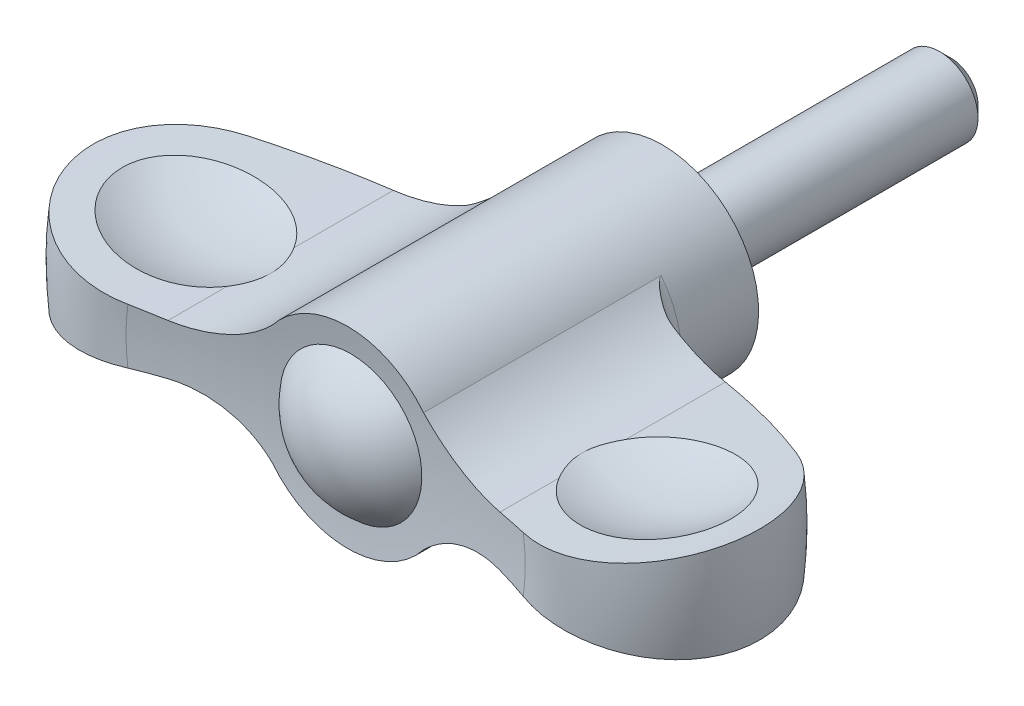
ISO-10303-21;
HEADER;
FILE_DESCRIPTION(('STEP AP214'),'2;1');
FILE_NAME('part.step','',(''),(''),'','','');
FILE_SCHEMA(('AUTOMOTIVE_DESIGN { 1 0 10303 214 1 1 1 1 }'));
ENDSEC;
DATA;
#1=APPLICATION_CONTEXT('core data for automotive mechanical design processes');
#2=APPLICATION_PROTOCOL_DEFINITION('international standard','automotive_design',2000,#1);
#3=PRODUCT_CONTEXT('',#1,'mechanical');
#4=PRODUCT('Part','Part','',(#3));
#5=PRODUCT_RELATED_PRODUCT_CATEGORY('part','',(#4));
#6=PRODUCT_DEFINITION_FORMATION('','',#4);
#7=PRODUCT_DEFINITION_CONTEXT('part definition',#1,'design');
#8=PRODUCT_DEFINITION('design','',#6,#7);
#9=PRODUCT_DEFINITION_SHAPE('','',#8);
#10=(LENGTH_UNIT() NAMED_UNIT(*) SI_UNIT(.MILLI.,.METRE.));
#11=(NAMED_UNIT(*) PLANE_ANGLE_UNIT() SI_UNIT($,.RADIAN.));
#12=(NAMED_UNIT(*) SI_UNIT($,.STERADIAN.) SOLID_ANGLE_UNIT());
#13=UNCERTAINTY_MEASURE_WITH_UNIT(LENGTH_MEASURE(1.E-05),#10,'distance_accuracy_value','');
#14=(GEOMETRIC_REPRESENTATION_CONTEXT(3) GLOBAL_UNCERTAINTY_ASSIGNED_CONTEXT((#13)) GLOBAL_UNIT_ASSIGNED_CONTEXT((#10,
#11,#12)) REPRESENTATION_CONTEXT('',''));
#15=CARTESIAN_POINT('',(0.,0.,0.));
#16=DIRECTION('',(0.,0.,1.));
#17=DIRECTION('',(1.,0.,0.));
#18=AXIS2_PLACEMENT_3D('',#15,#16,#17);
#19=CARTESIAN_POINT('',(0.,0.,8.));
#20=DIRECTION('',(0.,0.,-1.));
#21=DIRECTION('',(0.,1.,0.));
#22=AXIS2_PLACEMENT_3D('',#19,#20,#21);
#23=TOROIDAL_SURFACE('',#22,11.8,1.80000000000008);
#24=CARTESIAN_POINT('',(-10.936400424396,-3.94636818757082,9.7916319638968));
#25=CARTESIAN_POINT('',(-10.824118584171,-4.00370429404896,9.78325234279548));
#26=CARTESIAN_POINT('',(-10.7132133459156,-4.06254400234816,9.76897182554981));
#27=CARTESIAN_POINT('',(-10.4947965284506,-4.18269546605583,9.73031315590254));
#28=CARTESIAN_POINT('',(-10.3872790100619,-4.24400241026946,9.70595387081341));
#29=CARTESIAN_POINT('',(-10.1765147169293,-4.36838152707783,9.6489761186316));
#30=CARTESIAN_POINT('',(-10.0732455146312,-4.43144032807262,9.61641003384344));
#31=CARTESIAN_POINT('',(-9.87034998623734,-4.55941800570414,9.54423053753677));
#32=CARTESIAN_POINT('',(-9.77072514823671,-4.62433762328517,9.50461428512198));
#33=CARTESIAN_POINT('',(-9.55076497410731,-4.77218804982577,9.40879869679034));
#34=CARTESIAN_POINT('',(-9.43146470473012,-4.85557105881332,9.35092807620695));
#35=CARTESIAN_POINT('',(-9.19845422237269,-5.0245357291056,9.22749490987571));
#36=CARTESIAN_POINT('',(-9.08474708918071,-5.11011856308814,9.16192819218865));
#37=CARTESIAN_POINT('',(-8.89583509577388,-5.25740071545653,9.04459290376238));
#38=CARTESIAN_POINT('',(-8.81922141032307,-5.31864764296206,8.99450670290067));
#39=CARTESIAN_POINT('',(-8.66877804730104,-5.44185241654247,8.89113944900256));
#40=CARTESIAN_POINT('',(-8.59494804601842,-5.50381017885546,8.83785876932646));
#41=CARTESIAN_POINT('',(-8.4741799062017,-5.60755853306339,8.74594898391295));
#42=CARTESIAN_POINT('',(-8.42641392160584,-5.64925103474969,8.7082931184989));
#43=CARTESIAN_POINT('',(-8.33242521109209,-5.73256077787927,8.6310972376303));
#44=CARTESIAN_POINT('',(-8.28620142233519,-5.77417805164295,8.59155856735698));
#45=CARTESIAN_POINT('',(-8.21125367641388,-5.84266935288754,8.52388347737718));
#46=CARTESIAN_POINT('',(-8.18198002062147,-5.86968993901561,8.49650386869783));
#47=CARTESIAN_POINT('',(-8.12444979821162,-5.92330159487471,8.44010631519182));
#48=CARTESIAN_POINT('',(-8.09619524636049,-5.94989176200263,8.41108538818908));
#49=CARTESIAN_POINT('',(-8.04234032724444,-6.00103726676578,8.35179046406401));
#50=CARTESIAN_POINT('',(-8.01668026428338,-6.02563150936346,8.32160361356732));
#51=CARTESIAN_POINT('',(-7.96790958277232,-6.07276025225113,8.2576023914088));
#52=CARTESIAN_POINT('',(-7.94479257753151,-6.09529988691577,8.22379754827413));
#53=CARTESIAN_POINT('',(-7.91701322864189,-6.12255630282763,8.17250880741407));
#54=CARTESIAN_POINT('',(-7.90975258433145,-6.12970126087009,8.157793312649));
#55=CARTESIAN_POINT('',(-7.89665438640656,-6.14261741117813,8.12727584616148));
#56=CARTESIAN_POINT('',(-7.89080740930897,-6.14839769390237,8.11148202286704));
#57=CARTESIAN_POINT('',(-7.88158226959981,-6.15753000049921,8.08013275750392));
#58=CARTESIAN_POINT('',(-7.87802903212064,-6.16105398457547,8.06468423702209));
#59=CARTESIAN_POINT('',(-7.87307566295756,-6.16597001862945,8.03281428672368));
#60=CARTESIAN_POINT('',(-7.87172008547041,-6.16731795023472,8.01637956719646));
#61=CARTESIAN_POINT('',(-7.8717856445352,-6.16725149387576,7.9998));
#62=B_SPLINE_CURVE_WITH_KNOTS('',3,(#24,#25,#26,#27,#28,#29,#30,#31,#32,#33,#34,#35,#36,#37,#38,
#39,#40,#41,#42,#43,#44,#45,#46,#47,#48,#49,#50,#51,#52,#53,#54,#55,#56,#57,#58,#59,#60,#61),
.UNSPECIFIED.,.F.,.F.,(4,2,2,2,2,2,2,2,2,2,2,2,2,2,2,2,2,2,4),(0.,0.378686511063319,
0.756667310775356,1.13229407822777,1.50807255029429,1.97761636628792,2.44741590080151,
2.77774393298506,3.10803343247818,3.32923096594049,3.55027276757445,3.6952714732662,
3.84054267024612,3.98039395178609,4.11988557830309,4.17347981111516,4.22670627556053,
4.27513325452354,4.32453026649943),.UNSPECIFIED.);
#63=CARTESIAN_POINT('',(-10.9337221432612,-3.94773654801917,9.7914319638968));
#64=VERTEX_POINT('',#63);
#65=CARTESIAN_POINT('',(-7.8717855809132,-6.16725155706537,8.));
#66=VERTEX_POINT('',#65);
#67=EDGE_CURVE('E414',#64,#66,#62,.T.);
#68=ORIENTED_EDGE('',*,*,#67,.F.);
#69=CARTESIAN_POINT('',(0.,0.,9.7914319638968));
#70=DIRECTION('',(0.,0.,-1.));
#71=DIRECTION('',(0.,1.,0.));
#72=AXIS2_PLACEMENT_3D('',#69,#70,#71);
#73=CIRCLE('',#72,11.6245818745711);
#74=CARTESIAN_POINT('',(-10.9337221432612,3.94773654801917,9.7914319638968));
#75=VERTEX_POINT('',#74);
#76=EDGE_CURVE('E416',#64,#75,#73,.T.);
#77=ORIENTED_EDGE('',*,*,#76,.T.);
#78=CARTESIAN_POINT('',(-10.936400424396,3.94636818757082,9.7916319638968));
#79=CARTESIAN_POINT('',(-10.824118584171,4.00370429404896,9.78325234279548));
#80=CARTESIAN_POINT('',(-10.7132133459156,4.06254400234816,9.76897182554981));
#81=CARTESIAN_POINT('',(-10.4947965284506,4.18269546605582,9.73031315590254));
#82=CARTESIAN_POINT('',(-10.3872790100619,4.24400241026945,9.70595387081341));
#83=CARTESIAN_POINT('',(-10.1765147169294,4.36838152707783,9.64897611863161));
#84=CARTESIAN_POINT('',(-10.0732455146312,4.43144032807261,9.61641003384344));
#85=CARTESIAN_POINT('',(-9.87034998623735,4.55941800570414,9.54423053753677));
#86=CARTESIAN_POINT('',(-9.77072514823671,4.62433762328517,9.50461428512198));
#87=CARTESIAN_POINT('',(-9.55076497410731,4.77218804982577,9.40879869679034));
#88=CARTESIAN_POINT('',(-9.43146470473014,4.85557105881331,9.35092807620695));
#89=CARTESIAN_POINT('',(-9.1984542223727,5.02453572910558,9.22749490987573));
#90=CARTESIAN_POINT('',(-9.0847470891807,5.11011856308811,9.1619281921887));
#91=CARTESIAN_POINT('',(-8.89583509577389,5.25740071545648,9.04459290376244));
#92=CARTESIAN_POINT('',(-8.8192214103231,5.318647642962,8.99450670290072));
#93=CARTESIAN_POINT('',(-8.66877804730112,5.44185241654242,8.89113944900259));
#94=CARTESIAN_POINT('',(-8.59494804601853,5.50381017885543,8.8378587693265));
#95=CARTESIAN_POINT('',(-8.47417990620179,5.60755853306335,8.74594898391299));
#96=CARTESIAN_POINT('',(-8.4264139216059,5.64925103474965,8.70829311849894));
#97=CARTESIAN_POINT('',(-8.33242521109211,5.73256077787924,8.63109723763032));
#98=CARTESIAN_POINT('',(-8.2862014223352,5.77417805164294,8.59155856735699));
#99=CARTESIAN_POINT('',(-8.21125367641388,5.84266935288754,8.52388347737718));
#100=CARTESIAN_POINT('',(-8.18198002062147,5.86968993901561,8.49650386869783));
#101=CARTESIAN_POINT('',(-8.12444979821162,5.92330159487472,8.44010631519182));
#102=CARTESIAN_POINT('',(-8.09619524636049,5.94989176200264,8.41108538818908));
#103=CARTESIAN_POINT('',(-8.04234032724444,6.00103726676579,8.35179046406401));
#104=CARTESIAN_POINT('',(-8.01668026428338,6.02563150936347,8.32160361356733));
#105=CARTESIAN_POINT('',(-7.96790958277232,6.07276025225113,8.2576023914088));
#106=CARTESIAN_POINT('',(-7.94479257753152,6.09529988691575,8.22379754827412));
#107=CARTESIAN_POINT('',(-7.91701322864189,6.12255630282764,8.17250880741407));
#108=CARTESIAN_POINT('',(-7.90975258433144,6.1297012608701,8.15779331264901));
#109=CARTESIAN_POINT('',(-7.89665438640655,6.14261741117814,8.12727584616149));
#110=CARTESIAN_POINT('',(-7.89080740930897,6.14839769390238,8.11148202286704));
#111=CARTESIAN_POINT('',(-7.88158226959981,6.1575300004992,8.08013275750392));
#112=CARTESIAN_POINT('',(-7.87802903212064,6.16105398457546,8.06468423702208));
#113=CARTESIAN_POINT('',(-7.87307566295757,6.16597001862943,8.03281428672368));
#114=CARTESIAN_POINT('',(-7.87172008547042,6.16731795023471,8.01637956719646));
#115=CARTESIAN_POINT('',(-7.8717856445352,6.16725149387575,7.9998));
#116=B_SPLINE_CURVE_WITH_KNOTS('',3,(#78,#79,#80,#81,#82,#83,#84,#85,#86,#87,#88,#89,#90,#91,
#92,#93,#94,#95,#96,#97,#98,#99,#100,#101,#102,#103,#104,#105,#106,#107,#108,#109,#110,#111,
#112,#113,#114,#115),.UNSPECIFIED.,.F.,.F.,(4,2,2,2,2,2,2,2,2,2,2,2,2,2,2,2,2,2,4),(0.,
0.378686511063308,0.756667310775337,1.13229407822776,1.50807255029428,1.97761636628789,
2.44741590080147,2.77774393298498,3.10803343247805,3.32923096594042,3.55027276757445,
3.6952714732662,3.84054267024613,3.98039395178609,4.11988557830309,4.17347981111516,
4.22670627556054,4.27513325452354,4.32453026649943),.UNSPECIFIED.);
#117=CARTESIAN_POINT('',(-7.8717855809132,6.16725155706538,8.));
#118=VERTEX_POINT('',#117);
#119=EDGE_CURVE('E317',#75,#118,#116,.T.);
#120=ORIENTED_EDGE('',*,*,#119,.T.);
#121=CARTESIAN_POINT('',(0.,0.,8.));
#122=DIRECTION('',(0.,0.,-1.));
#123=DIRECTION('',(0.,1.,0.));
#124=AXIS2_PLACEMENT_3D('',#121,#122,#123);
#125=CIRCLE('',#124,10.);
#126=EDGE_CURVE('E418',#66,#118,#125,.T.);
#127=ORIENTED_EDGE('',*,*,#126,.F.);
#128=EDGE_LOOP('',(#68,#77,#120,#127));
#129=FACE_BOUND('',#128,.T.);
#130=ADVANCED_FACE('F14',(#129),#23,.F.);
#131=CARTESIAN_POINT('',(0.,0.,60.3122983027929));
#132=DIRECTION('',(0.,0.,-1.));
#133=DIRECTION('',(0.,1.,0.));
#134=AXIS2_PLACEMENT_3D('',#131,#132,#133);
#135=DEGENERATE_TOROIDAL_SURFACE('',#134,6.6775474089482,50.7624968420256,.T.);
#136=ORIENTED_EDGE('',*,*,#76,.F.);
#137=CARTESIAN_POINT('',(-6.5467060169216,-7.72330133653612,9.66697769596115));
#138=CARTESIAN_POINT('',(-6.64591288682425,-7.58492422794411,9.66416255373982));
#139=CARTESIAN_POINT('',(-6.74799440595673,-7.44862247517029,9.661900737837));
#140=CARTESIAN_POINT('',(-6.95774811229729,-7.18037757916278,9.65844214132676));
#141=CARTESIAN_POINT('',(-7.06542027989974,-7.04843442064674,9.6572453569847));
#142=CARTESIAN_POINT('',(-7.39653737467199,-6.6595102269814,9.65519040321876));
#143=CARTESIAN_POINT('',(-7.62812663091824,-6.40937348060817,9.65586643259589));
#144=CARTESIAN_POINT('',(-8.11129299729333,-5.92925394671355,9.66138002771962));
#145=CARTESIAN_POINT('',(-8.36287299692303,-5.69927408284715,9.66621819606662));
#146=CARTESIAN_POINT('',(-8.88421895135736,-5.26109545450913,9.68055080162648));
#147=CARTESIAN_POINT('',(-9.15398440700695,-5.05289609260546,9.69004511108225));
#148=CARTESIAN_POINT('',(-9.70731186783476,-4.66146851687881,9.71434109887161));
#149=CARTESIAN_POINT('',(-9.99073342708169,-4.47803881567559,9.72909588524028));
#150=CARTESIAN_POINT('',(-10.5714417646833,-4.13530031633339,9.76473262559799));
#151=CARTESIAN_POINT('',(-10.8687285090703,-3.97599145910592,9.78561456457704));
#152=CARTESIAN_POINT('',(-11.4746831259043,-3.68269992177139,9.83420440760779));
#153=CARTESIAN_POINT('',(-11.7833407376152,-3.54869504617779,9.86190627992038));
#154=CARTESIAN_POINT('',(-12.4099583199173,-3.30668939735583,9.92468529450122));
#155=CARTESIAN_POINT('',(-12.72791823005,-3.19868845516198,9.95976238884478));
#156=CARTESIAN_POINT('',(-13.3702784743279,-3.00943594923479,10.0375625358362));
#157=CARTESIAN_POINT('',(-13.694668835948,-2.92814595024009,10.080274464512));
#158=CARTESIAN_POINT('',(-14.3479208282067,-2.7924555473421,10.173495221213));
#159=CARTESIAN_POINT('',(-14.6767824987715,-2.73805538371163,10.2240041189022));
#160=CARTESIAN_POINT('',(-15.3369192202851,-2.65620760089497,10.3328061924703));
#161=CARTESIAN_POINT('',(-15.6681964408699,-2.62878831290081,10.3911074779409));
#162=CARTESIAN_POINT('',(-16.3304789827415,-2.60086726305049,10.5152293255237));
#163=CARTESIAN_POINT('',(-16.6614842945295,-2.60036640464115,10.5810501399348));
#164=CARTESIAN_POINT('',(-17.3240428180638,-2.62605289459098,10.7205107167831));
#165=CARTESIAN_POINT('',(-17.6555720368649,-2.65249066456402,10.7942180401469));
#166=CARTESIAN_POINT('',(-18.3138495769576,-2.73187573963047,10.9484805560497));
#167=CARTESIAN_POINT('',(-18.6405974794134,-2.78482535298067,11.0290363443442));
#168=CARTESIAN_POINT('',(-19.2867879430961,-2.91642655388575,11.1963521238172));
#169=CARTESIAN_POINT('',(-19.6062391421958,-2.99504586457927,11.2831042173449));
#170=CARTESIAN_POINT('',(-20.2362844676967,-3.17708996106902,11.4622866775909));
#171=CARTESIAN_POINT('',(-20.5468805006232,-3.28050936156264,11.5547158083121));
#172=CARTESIAN_POINT('',(-20.8521318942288,-3.39588894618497,11.6496949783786));
#173=B_SPLINE_CURVE_WITH_KNOTS('',3,(#137,#138,#139,#140,#141,#142,#143,#144,#145,#146,#147,
#148,#149,#150,#151,#152,#153,#154,#155,#156,#157,#158,#159,#160,#161,#162,#163,#164,#165,#166,
#167,#168,#169,#170,#171,#172),.UNSPECIFIED.,.F.,.F.,(4,2,2,2,2,2,2,2,2,2,2,2,2,2,2,2,2,4),(0.,
0.510785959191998,1.02157012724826,2.04291399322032,3.06440575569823,4.08586949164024,
5.09844663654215,6.11102130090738,7.12270361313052,8.13437935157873,9.14459291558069,
10.1548155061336,11.1660977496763,12.1774139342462,13.1982178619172,14.2191106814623,
15.2387247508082,16.2581176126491),.UNSPECIFIED.);
#174=CARTESIAN_POINT('',(-17.2513916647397,-2.62600423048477,10.7060191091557));
#175=VERTEX_POINT('',#174);
#176=EDGE_CURVE('E422',#64,#175,#173,.T.);
#177=ORIENTED_EDGE('',*,*,#176,.T.);
#178=CARTESIAN_POINT('',(-28.5420587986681,-3.86093353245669,14.6248916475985));
#179=CARTESIAN_POINT('',(-28.0949251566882,-3.78973654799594,14.4056959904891));
#180=CARTESIAN_POINT('',(-27.6441940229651,-3.72065339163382,14.1932196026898));
#181=CARTESIAN_POINT('',(-26.7359054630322,-3.58698745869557,13.7818878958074));
#182=CARTESIAN_POINT('',(-26.2783480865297,-3.52240464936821,13.583032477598));
#183=CARTESIAN_POINT('',(-24.8998297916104,-3.33633398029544,13.0087706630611));
#184=CARTESIAN_POINT('',(-23.9692804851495,-3.22192463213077,12.6538347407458));
#185=CARTESIAN_POINT('',(-22.0863023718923,-3.01405683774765,12.0002442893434));
#186=CARTESIAN_POINT('',(-21.133873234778,-2.92059870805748,11.701590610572));
#187=CARTESIAN_POINT('',(-19.6898454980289,-2.79722984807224,11.296179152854));
#188=CARTESIAN_POINT('',(-19.2049108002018,-2.75884755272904,11.1679139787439));
#189=CARTESIAN_POINT('',(-18.2309836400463,-2.68796520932,10.9259763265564));
#190=CARTESIAN_POINT('',(-17.7419911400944,-2.65546521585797,10.8123039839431));
#191=CARTESIAN_POINT('',(-17.2511916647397,-2.6259922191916,10.7059757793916));
#192=B_SPLINE_CURVE_WITH_KNOTS('',3,(#178,#179,#180,#181,#182,#183,#184,#185,#186,#187,#188,
#189,#190,#191),.UNSPECIFIED.,.F.,.F.,(4,2,2,2,2,2,4),(0.,1.50898291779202,3.01795485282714,
6.0232908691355,9.02867228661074,10.5376740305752,12.0466897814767),.UNSPECIFIED.);
#193=CARTESIAN_POINT('',(-28.5416508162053,-3.86086857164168,14.6246916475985));
#194=VERTEX_POINT('',#193);
#195=EDGE_CURVE('E504',#194,#175,#192,.T.);
#196=ORIENTED_EDGE('',*,*,#195,.F.);
#197=CARTESIAN_POINT('',(0.,0.,14.6246916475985));
#198=DIRECTION('',(0.,0.,-1.));
#199=DIRECTION('',(0.,1.,0.));
#200=AXIS2_PLACEMENT_3D('',#197,#198,#199);
#201=CIRCLE('',#200,28.8015995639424);
#202=CARTESIAN_POINT('',(-28.5416508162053,3.86086857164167,14.6246916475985));
#203=VERTEX_POINT('',#202);
#204=EDGE_CURVE('E432',#194,#203,#201,.T.);
#205=ORIENTED_EDGE('',*,*,#204,.T.);
#206=CARTESIAN_POINT('',(-28.542058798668,3.86093353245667,14.6248916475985));
#207=CARTESIAN_POINT('',(-28.0949251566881,3.78973654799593,14.4056959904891));
#208=CARTESIAN_POINT('',(-27.644194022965,3.7206533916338,14.1932196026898));
#209=CARTESIAN_POINT('',(-26.7359054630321,3.58698745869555,13.7818878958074));
#210=CARTESIAN_POINT('',(-26.2783480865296,3.52240464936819,13.583032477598));
#211=CARTESIAN_POINT('',(-24.8998297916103,3.33633398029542,13.0087706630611));
#212=CARTESIAN_POINT('',(-23.9692804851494,3.22192463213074,12.6538347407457));
#213=CARTESIAN_POINT('',(-22.0863023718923,3.01405683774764,12.0002442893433));
#214=CARTESIAN_POINT('',(-21.133873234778,2.92059870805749,11.701590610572));
#215=CARTESIAN_POINT('',(-19.6898454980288,2.79722984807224,11.296179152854));
#216=CARTESIAN_POINT('',(-19.2049108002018,2.75884755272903,11.1679139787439));
#217=CARTESIAN_POINT('',(-18.2309836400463,2.68796520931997,10.9259763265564));
#218=CARTESIAN_POINT('',(-17.7419911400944,2.65546521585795,10.8123039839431));
#219=CARTESIAN_POINT('',(-17.2511916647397,2.6259922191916,10.7059757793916));
#220=B_SPLINE_CURVE_WITH_KNOTS('',3,(#206,#207,#208,#209,#210,#211,#212,#213,#214,#215,#216,
#217,#218,#219),.UNSPECIFIED.,.F.,.F.,(4,2,2,2,2,2,4),(0.,1.50898291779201,3.01795485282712,
6.02329086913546,9.02867228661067,10.5376740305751,12.0466897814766),.UNSPECIFIED.);
#221=CARTESIAN_POINT('',(-17.2513916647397,2.62600423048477,10.7060191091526));
#222=VERTEX_POINT('',#221);
#223=EDGE_CURVE('E331',#203,#222,#220,.T.);
#224=ORIENTED_EDGE('',*,*,#223,.T.);
#225=CARTESIAN_POINT('',(-6.5467060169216,7.72330133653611,9.66697769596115));
#226=CARTESIAN_POINT('',(-6.64591288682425,7.5849242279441,9.66416255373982));
#227=CARTESIAN_POINT('',(-6.74799440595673,7.44862247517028,9.661900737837));
#228=CARTESIAN_POINT('',(-6.9577481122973,7.18037757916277,9.65844214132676));
#229=CARTESIAN_POINT('',(-7.06542027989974,7.04843442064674,9.6572453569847));
#230=CARTESIAN_POINT('',(-7.39653737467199,6.65951022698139,9.65519040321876));
#231=CARTESIAN_POINT('',(-7.62812663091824,6.40937348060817,9.65586643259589));
#232=CARTESIAN_POINT('',(-8.11129299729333,5.92925394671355,9.66138002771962));
#233=CARTESIAN_POINT('',(-8.36287299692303,5.69927408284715,9.66621819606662));
#234=CARTESIAN_POINT('',(-8.88421895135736,5.26109545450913,9.68055080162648));
#235=CARTESIAN_POINT('',(-9.15398440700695,5.05289609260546,9.69004511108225));
#236=CARTESIAN_POINT('',(-9.70731186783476,4.66146851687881,9.71434109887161));
#237=CARTESIAN_POINT('',(-9.99073342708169,4.47803881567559,9.72909588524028));
#238=CARTESIAN_POINT('',(-10.5714417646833,4.13530031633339,9.76473262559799));
#239=CARTESIAN_POINT('',(-10.8687285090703,3.97599145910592,9.78561456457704));
#240=CARTESIAN_POINT('',(-11.4746831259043,3.68269992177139,9.83420440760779));
#241=CARTESIAN_POINT('',(-11.7833407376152,3.54869504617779,9.86190627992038));
#242=CARTESIAN_POINT('',(-12.4099583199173,3.30668939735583,9.92468529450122));
#243=CARTESIAN_POINT('',(-12.72791823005,3.19868845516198,9.95976238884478));
#244=CARTESIAN_POINT('',(-13.3702784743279,3.00943594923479,10.0375625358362));
#245=CARTESIAN_POINT('',(-13.694668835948,2.92814595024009,10.080274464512));
#246=CARTESIAN_POINT('',(-14.3479208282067,2.7924555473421,10.173495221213));
#247=CARTESIAN_POINT('',(-14.6767824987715,2.73805538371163,10.2240041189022));
#248=CARTESIAN_POINT('',(-15.3369192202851,2.65620760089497,10.3328061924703));
#249=CARTESIAN_POINT('',(-15.6681964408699,2.62878831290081,10.3911074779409));
#250=CARTESIAN_POINT('',(-16.3304789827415,2.60086726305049,10.5152293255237));
#251=CARTESIAN_POINT('',(-16.6614842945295,2.60036640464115,10.5810501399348));
#252=CARTESIAN_POINT('',(-17.3240428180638,2.62605289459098,10.7205107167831));
#253=CARTESIAN_POINT('',(-17.6555720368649,2.65249066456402,10.7942180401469));
#254=CARTESIAN_POINT('',(-18.3138495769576,2.73187573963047,10.9484805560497));
#255=CARTESIAN_POINT('',(-18.6405974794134,2.78482535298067,11.0290363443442));
#256=CARTESIAN_POINT('',(-19.2867879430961,2.91642655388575,11.1963521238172));
#257=CARTESIAN_POINT('',(-19.6062391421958,2.99504586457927,11.2831042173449));
#258=CARTESIAN_POINT('',(-20.2362844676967,3.17708996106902,11.4622866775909));
#259=CARTESIAN_POINT('',(-20.5468805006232,3.28050936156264,11.5547158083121));
#260=CARTESIAN_POINT('',(-20.8521318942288,3.39588894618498,11.6496949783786));
#261=B_SPLINE_CURVE_WITH_KNOTS('',3,(#225,#226,#227,#228,#229,#230,#231,#232,#233,#234,#235,
#236,#237,#238,#239,#240,#241,#242,#243,#244,#245,#246,#247,#248,#249,#250,#251,#252,#253,#254,
#255,#256,#257,#258,#259,#260),.UNSPECIFIED.,.F.,.F.,(4,2,2,2,2,2,2,2,2,2,2,2,2,2,2,2,2,4),(0.,
0.510785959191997,1.02157012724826,2.04291399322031,3.06440575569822,4.08586949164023,
5.09844663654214,6.11102130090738,7.12270361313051,8.13437935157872,9.14459291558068,
10.1548155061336,11.1660977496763,12.1774139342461,13.1982178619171,14.2191106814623,
15.2387247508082,16.2581176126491),.UNSPECIFIED.);
#262=EDGE_CURVE('E300',#75,#222,#261,.T.);
#263=ORIENTED_EDGE('',*,*,#262,.F.);
#264=EDGE_LOOP('',(#136,#177,#196,#205,#224,#263));
#265=FACE_BOUND('',#264,.T.);
#266=ADVANCED_FACE('F405',(#265),#135,.T.);
#267=CARTESIAN_POINT('',(0.,0.,24.5131504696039));
#268=DIRECTION('',(0.,0.,-1.));
#269=DIRECTION('',(0.,1.,0.));
#270=AXIS2_PLACEMENT_3D('',#267,#268,#269);
#271=TOROIDAL_SURFACE('',#270,24.0131504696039,10.9868495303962);
#272=CARTESIAN_POINT('',(-17.2511916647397,-2.62599221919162,33.3242100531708));
#273=CARTESIAN_POINT('',(-17.4993781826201,-2.64089075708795,33.5086851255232));
#274=CARTESIAN_POINT('',(-17.7552628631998,-2.65706460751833,33.6826969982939));
#275=CARTESIAN_POINT('',(-18.28053769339,-2.69210530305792,34.0086627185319));
#276=CARTESIAN_POINT('',(-18.5499277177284,-2.71097212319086,34.1606167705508));
#277=CARTESIAN_POINT('',(-19.1002002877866,-2.75153205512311,34.4412740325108));
#278=CARTESIAN_POINT('',(-19.381077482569,-2.77322386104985,34.5699879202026));
#279=CARTESIAN_POINT('',(-19.952432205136,-2.81952002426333,34.8033129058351));
#280=CARTESIAN_POINT('',(-20.2429095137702,-2.84412431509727,34.9079245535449));
#281=CARTESIAN_POINT('',(-20.8315983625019,-2.89628797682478,35.0923323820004));
#282=CARTESIAN_POINT('',(-21.1298150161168,-2.92384934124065,35.1721116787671));
#283=CARTESIAN_POINT('',(-21.7316508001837,-2.98187199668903,35.3061577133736));
#284=CARTESIAN_POINT('',(-22.035269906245,-3.01233327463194,35.3604245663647));
#285=CARTESIAN_POINT('',(-22.6456357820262,-3.0760359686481,35.4430189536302));
#286=CARTESIAN_POINT('',(-22.9523815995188,-3.10927655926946,35.4713541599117));
#287=CARTESIAN_POINT('',(-23.566877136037,-3.17836345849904,35.501889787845));
#288=CARTESIAN_POINT('',(-23.874626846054,-3.21420974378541,35.504090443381));
#289=CARTESIAN_POINT('',(-24.4874432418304,-3.28807700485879,35.4823817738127));
#290=CARTESIAN_POINT('',(-24.7925157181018,-3.32608674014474,35.4585974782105));
#291=CARTESIAN_POINT('',(-25.3992908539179,-3.404117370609,35.3852808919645));
#292=CARTESIAN_POINT('',(-25.7009935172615,-3.44413826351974,35.3357486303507));
#293=CARTESIAN_POINT('',(-26.2989412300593,-3.52581537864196,35.211278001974));
#294=CARTESIAN_POINT('',(-26.595185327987,-3.56747188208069,35.1363352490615));
#295=CARTESIAN_POINT('',(-27.1800717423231,-3.65197221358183,34.9615826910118));
#296=CARTESIAN_POINT('',(-27.4687140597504,-3.69481604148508,34.8617728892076));
#297=CARTESIAN_POINT('',(-28.035952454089,-3.78113479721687,34.6381665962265));
#298=CARTESIAN_POINT('',(-28.3145627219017,-3.82460870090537,34.514405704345));
#299=CARTESIAN_POINT('',(-28.8602471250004,-3.9117173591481,34.2436848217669));
#300=CARTESIAN_POINT('',(-29.1273212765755,-3.9553521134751,34.0967248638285));
#301=CARTESIAN_POINT('',(-29.6480727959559,-4.04221651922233,33.7806574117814));
#302=CARTESIAN_POINT('',(-29.9017509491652,-4.08544619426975,33.6115512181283));
#303=CARTESIAN_POINT('',(-30.3939845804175,-4.17091924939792,33.2523788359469));
#304=CARTESIAN_POINT('',(-30.6325400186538,-4.21316262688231,33.0623125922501));
#305=CARTESIAN_POINT('',(-31.0935716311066,-4.29619199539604,32.6619711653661));
#306=CARTESIAN_POINT('',(-31.3159985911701,-4.33697334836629,32.4516383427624));
#307=CARTESIAN_POINT('',(-31.7424740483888,-4.41635307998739,32.0127202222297));
#308=CARTESIAN_POINT('',(-31.9465225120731,-4.45495145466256,31.7841348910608));
#309=CARTESIAN_POINT('',(-32.3348520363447,-4.5293877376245,31.3103146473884));
#310=CARTESIAN_POINT('',(-32.5191323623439,-4.56522554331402,31.0650791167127));
#311=CARTESIAN_POINT('',(-32.8666572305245,-4.63358841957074,30.5596945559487));
#312=CARTESIAN_POINT('',(-33.0299017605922,-4.66611348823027,30.2995455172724));
#313=CARTESIAN_POINT('',(-33.3345075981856,-4.72739462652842,29.7656976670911));
#314=CARTESIAN_POINT('',(-33.4758297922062,-4.75614394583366,29.4919757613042));
#315=CARTESIAN_POINT('',(-33.7352733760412,-4.80934524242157,28.9333467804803));
#316=CARTESIAN_POINT('',(-33.8533947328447,-4.83379721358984,28.6484396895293));
#317=CARTESIAN_POINT('',(-34.0656204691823,-4.87800530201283,28.0694731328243));
#318=CARTESIAN_POINT('',(-34.1597255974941,-4.89776156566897,27.7754139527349));
#319=CARTESIAN_POINT('',(-34.3232748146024,-4.93225390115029,27.180228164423));
#320=CARTESIAN_POINT('',(-34.3927189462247,-4.94698998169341,26.8791015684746));
#321=CARTESIAN_POINT('',(-34.5063857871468,-4.97117989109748,26.2723608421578));
#322=CARTESIAN_POINT('',(-34.5506442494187,-4.98064120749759,25.96675370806));
#323=CARTESIAN_POINT('',(-34.6137870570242,-4.99415603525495,25.3528106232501));
#324=CARTESIAN_POINT('',(-34.6326714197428,-4.99820955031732,25.0444746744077));
#325=CARTESIAN_POINT('',(-34.644935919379,-5.00084099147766,24.4272603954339));
#326=CARTESIAN_POINT('',(-34.6383150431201,-4.99941870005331,24.1183820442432));
#327=CARTESIAN_POINT('',(-34.5996125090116,-4.9911218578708,23.5022985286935));
#328=CARTESIAN_POINT('',(-34.5675308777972,-4.9842473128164,23.1950933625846));
#329=CARTESIAN_POINT('',(-34.4781950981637,-4.96517513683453,22.5850017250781));
#330=CARTESIAN_POINT('',(-34.4209785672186,-4.95298546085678,22.2821094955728));
#331=CARTESIAN_POINT('',(-34.2817747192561,-4.92348679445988,21.6823260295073));
#332=CARTESIAN_POINT('',(-34.1997873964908,-4.90617780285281,21.3854347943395));
#333=CARTESIAN_POINT('',(-34.0116119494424,-4.86672680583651,20.799780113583));
#334=CARTESIAN_POINT('',(-33.9054257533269,-4.84458518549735,20.5110160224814));
#335=CARTESIAN_POINT('',(-33.6695763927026,-4.79582854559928,19.9436331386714));
#336=CARTESIAN_POINT('',(-33.5399133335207,-4.76921354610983,19.6650143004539));
#337=CARTESIAN_POINT('',(-33.2578321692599,-4.71190410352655,19.1195687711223));
#338=CARTESIAN_POINT('',(-33.1053878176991,-4.68120495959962,18.8527561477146));
#339=CARTESIAN_POINT('',(-32.7788934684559,-4.61623623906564,18.3331441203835));
#340=CARTESIAN_POINT('',(-32.6048429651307,-4.58196657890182,18.0803450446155));
#341=CARTESIAN_POINT('',(-32.2363296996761,-4.51038975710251,17.5905487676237));
#342=CARTESIAN_POINT('',(-32.0418667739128,-4.47308257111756,17.3535516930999));
#343=CARTESIAN_POINT('',(-31.633867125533,-4.39599896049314,16.8970435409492));
#344=CARTESIAN_POINT('',(-31.4203320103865,-4.35622274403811,16.6775309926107));
#345=CARTESIAN_POINT('',(-31.0011481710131,-4.27945832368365,16.2816097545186));
#346=CARTESIAN_POINT('',(-30.797399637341,-4.24267293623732,16.103144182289));
#347=CARTESIAN_POINT('',(-30.377205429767,-4.16804353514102,15.7621159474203));
#348=CARTESIAN_POINT('',(-30.1607608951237,-4.13019961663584,15.5995518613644));
#349=CARTESIAN_POINT('',(-29.7163820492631,-4.05387450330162,15.2912603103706));
#350=CARTESIAN_POINT('',(-29.4884504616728,-4.01539346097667,15.1455288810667));
#351=CARTESIAN_POINT('',(-29.0222683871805,-3.9381829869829,14.871631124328));
#352=CARTESIAN_POINT('',(-28.7840165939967,-3.89945352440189,14.7434670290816));
#353=CARTESIAN_POINT('',(-28.5412428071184,-3.86080360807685,14.6244916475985));
#354=B_SPLINE_CURVE_WITH_KNOTS('',3,(#272,#273,#274,#275,#276,#277,#278,#279,#280,#281,#282,
#283,#284,#285,#286,#287,#288,#289,#290,#291,#292,#293,#294,#295,#296,#297,#298,#299,#300,#301,
#302,#303,#304,#305,#306,#307,#308,#309,#310,#311,#312,#313,#314,#315,#316,#317,#318,#319,#320,
#321,#322,#323,#324,#325,#326,#327,#328,#329,#330,#331,#332,#333,#334,#335,#336,#337,#338,#339,
#340,#341,#342,#343,#344,#345,#346,#347,#348,#349,#350,#351,#352,#353),.UNSPECIFIED.,.F.,.F.,(4,
2,2,2,2,2,2,2,2,2,2,2,2,2,2,2,2,2,2,2,2,2,2,2,2,2,2,2,2,2,2,2,2,2,2,2,2,2,2,2,4),(0.,
0.928513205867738,1.85701780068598,2.7850947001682,3.7131504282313,4.64183578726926,
5.57051695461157,6.49892327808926,7.42732129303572,8.35127181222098,9.27522128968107,
10.1993303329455,11.1234392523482,12.0461850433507,12.9689295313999,13.8916198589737,
14.8143126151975,15.7397117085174,16.6651124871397,17.5905476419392,18.5159833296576,
19.4430516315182,20.3701212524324,21.2971619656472,22.2242010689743,23.1499208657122,
24.0756400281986,25.0013959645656,25.9271509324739,26.8515250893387,27.7758994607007,
28.7002002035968,29.6244967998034,30.5498666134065,31.4752580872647,32.4006569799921,
33.3259779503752,34.1452666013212,34.9644818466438,35.7835037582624,36.6026296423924),.UNSPECIFIED.);
#355=CARTESIAN_POINT('',(-20.5453214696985,-2.87092129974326,35.0026521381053));
#356=VERTEX_POINT('',#355);
#357=EDGE_CURVE('E495',#356,#194,#354,.T.);
#358=ORIENTED_EDGE('',*,*,#357,.F.);
#359=CARTESIAN_POINT('',(0.,0.,35.0026521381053));
#360=DIRECTION('',(0.,0.,-1.));
#361=DIRECTION('',(0.,1.,0.));
#362=AXIS2_PLACEMENT_3D('',#359,#360,#361);
#363=CIRCLE('',#362,20.7449372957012);
#364=CARTESIAN_POINT('',(-20.5453214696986,2.87092129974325,35.0026521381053));
#365=VERTEX_POINT('',#364);
#366=EDGE_CURVE('E485',#356,#365,#363,.T.);
#367=ORIENTED_EDGE('',*,*,#366,.T.);
#368=CARTESIAN_POINT('',(-17.2511916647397,2.6259922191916,33.3242100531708));
#369=CARTESIAN_POINT('',(-17.4993781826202,2.64089075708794,33.5086851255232));
#370=CARTESIAN_POINT('',(-17.7552628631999,2.65706460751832,33.6826969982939));
#371=CARTESIAN_POINT('',(-18.28053769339,2.69210530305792,34.0086627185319));
#372=CARTESIAN_POINT('',(-18.5499277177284,2.71097212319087,34.1606167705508));
#373=CARTESIAN_POINT('',(-19.1002002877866,2.75153205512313,34.4412740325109));
#374=CARTESIAN_POINT('',(-19.3810774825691,2.77322386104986,34.5699879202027));
#375=CARTESIAN_POINT('',(-19.952432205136,2.81952002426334,34.8033129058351));
#376=CARTESIAN_POINT('',(-20.2429095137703,2.84412431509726,34.9079245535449));
#377=CARTESIAN_POINT('',(-20.831598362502,2.89628797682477,35.0923323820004));
#378=CARTESIAN_POINT('',(-21.1298150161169,2.92384934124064,35.1721116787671));
#379=CARTESIAN_POINT('',(-21.7316508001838,2.98187199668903,35.3061577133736));
#380=CARTESIAN_POINT('',(-22.0352699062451,3.01233327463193,35.3604245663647));
#381=CARTESIAN_POINT('',(-22.6456357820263,3.0760359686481,35.4430189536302));
#382=CARTESIAN_POINT('',(-22.9523815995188,3.10927655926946,35.4713541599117));
#383=CARTESIAN_POINT('',(-23.566877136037,3.17836345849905,35.501889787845));
#384=CARTESIAN_POINT('',(-23.874626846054,3.21420974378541,35.504090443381));
#385=CARTESIAN_POINT('',(-24.4874432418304,3.28807700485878,35.4823817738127));
#386=CARTESIAN_POINT('',(-24.7925157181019,3.32608674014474,35.4585974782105));
#387=CARTESIAN_POINT('',(-25.3992908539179,3.404117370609,35.3852808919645));
#388=CARTESIAN_POINT('',(-25.7009935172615,3.44413826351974,35.3357486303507));
#389=CARTESIAN_POINT('',(-26.2989412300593,3.52581537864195,35.211278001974));
#390=CARTESIAN_POINT('',(-26.595185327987,3.56747188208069,35.1363352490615));
#391=CARTESIAN_POINT('',(-27.1800717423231,3.65197221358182,34.9615826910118));
#392=CARTESIAN_POINT('',(-27.4687140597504,3.69481604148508,34.8617728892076));
#393=CARTESIAN_POINT('',(-28.035952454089,3.78113479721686,34.6381665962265));
#394=CARTESIAN_POINT('',(-28.3145627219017,3.82460870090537,34.514405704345));
#395=CARTESIAN_POINT('',(-28.8602471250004,3.9117173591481,34.2436848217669));
#396=CARTESIAN_POINT('',(-29.1273212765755,3.9553521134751,34.0967248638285));
#397=CARTESIAN_POINT('',(-29.6480727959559,4.04221651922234,33.7806574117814));
#398=CARTESIAN_POINT('',(-29.9017509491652,4.08544619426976,33.6115512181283));
#399=CARTESIAN_POINT('',(-30.3939845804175,4.17091924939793,33.2523788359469));
#400=CARTESIAN_POINT('',(-30.6325400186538,4.21316262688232,33.0623125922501));
#401=CARTESIAN_POINT('',(-31.0935716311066,4.29619199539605,32.6619711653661));
#402=CARTESIAN_POINT('',(-31.3159985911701,4.33697334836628,32.4516383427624));
#403=CARTESIAN_POINT('',(-31.7424740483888,4.41635307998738,32.0127202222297));
#404=CARTESIAN_POINT('',(-31.9465225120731,4.45495145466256,31.7841348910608));
#405=CARTESIAN_POINT('',(-32.3348520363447,4.52938773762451,31.3103146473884));
#406=CARTESIAN_POINT('',(-32.5191323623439,4.56522554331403,31.0650791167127));
#407=CARTESIAN_POINT('',(-32.8666572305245,4.63358841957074,30.5596945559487));
#408=CARTESIAN_POINT('',(-33.0299017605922,4.66611348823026,30.2995455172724));
#409=CARTESIAN_POINT('',(-33.3345075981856,4.72739462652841,29.7656976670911));
#410=CARTESIAN_POINT('',(-33.4758297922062,4.75614394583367,29.4919757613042));
#411=CARTESIAN_POINT('',(-33.7352733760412,4.80934524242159,28.9333467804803));
#412=CARTESIAN_POINT('',(-33.8533947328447,4.83379721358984,28.6484396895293));
#413=CARTESIAN_POINT('',(-34.0656204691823,4.87800530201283,28.0694731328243));
#414=CARTESIAN_POINT('',(-34.1597255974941,4.89776156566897,27.7754139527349));
#415=CARTESIAN_POINT('',(-34.3232748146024,4.93225390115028,27.180228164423));
#416=CARTESIAN_POINT('',(-34.3927189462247,4.9469899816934,26.8791015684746));
#417=CARTESIAN_POINT('',(-34.5063857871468,4.97117989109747,26.2723608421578));
#418=CARTESIAN_POINT('',(-34.5506442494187,4.9806412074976,25.96675370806));
#419=CARTESIAN_POINT('',(-34.6137870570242,4.99415603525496,25.3528106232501));
#420=CARTESIAN_POINT('',(-34.6326714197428,4.99820955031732,25.0444746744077));
#421=CARTESIAN_POINT('',(-34.644935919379,5.00084099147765,24.4272603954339));
#422=CARTESIAN_POINT('',(-34.6383150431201,4.9994187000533,24.1183820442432));
#423=CARTESIAN_POINT('',(-34.5996125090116,4.99112185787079,23.5022985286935));
#424=CARTESIAN_POINT('',(-34.5675308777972,4.98424731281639,23.1950933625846));
#425=CARTESIAN_POINT('',(-34.4781950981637,4.96517513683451,22.5850017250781));
#426=CARTESIAN_POINT('',(-34.4209785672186,4.95298546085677,22.2821094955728));
#427=CARTESIAN_POINT('',(-34.2817747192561,4.92348679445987,21.6823260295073));
#428=CARTESIAN_POINT('',(-34.1997873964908,4.90617780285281,21.3854347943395));
#429=CARTESIAN_POINT('',(-34.0116119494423,4.86672680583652,20.7997801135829));
#430=CARTESIAN_POINT('',(-33.9054257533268,4.84458518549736,20.5110160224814));
#431=CARTESIAN_POINT('',(-33.6695763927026,4.79582854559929,19.9436331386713));
#432=CARTESIAN_POINT('',(-33.5399133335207,4.76921354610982,19.6650143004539));
#433=CARTESIAN_POINT('',(-33.2578321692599,4.71190410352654,19.1195687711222));
#434=CARTESIAN_POINT('',(-33.1053878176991,4.68120495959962,18.8527561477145));
#435=CARTESIAN_POINT('',(-32.7788934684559,4.61623623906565,18.3331441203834));
#436=CARTESIAN_POINT('',(-32.6048429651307,4.58196657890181,18.0803450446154));
#437=CARTESIAN_POINT('',(-32.2363296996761,4.5103897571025,17.5905487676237));
#438=CARTESIAN_POINT('',(-32.0418667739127,4.47308257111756,17.3535516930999));
#439=CARTESIAN_POINT('',(-31.633867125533,4.39599896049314,16.8970435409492));
#440=CARTESIAN_POINT('',(-31.4203320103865,4.3562227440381,16.6775309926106));
#441=CARTESIAN_POINT('',(-31.0011481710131,4.27945832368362,16.2816097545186));
#442=CARTESIAN_POINT('',(-30.797399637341,4.2426729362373,16.103144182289));
#443=CARTESIAN_POINT('',(-30.377205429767,4.16804353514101,15.7621159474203));
#444=CARTESIAN_POINT('',(-30.1607608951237,4.13019961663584,15.5995518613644));
#445=CARTESIAN_POINT('',(-29.7163820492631,4.05387450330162,15.2912603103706));
#446=CARTESIAN_POINT('',(-29.4884504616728,4.01539346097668,15.1455288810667));
#447=CARTESIAN_POINT('',(-29.0222683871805,3.93818298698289,14.871631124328));
#448=CARTESIAN_POINT('',(-28.7840165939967,3.89945352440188,14.7434670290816));
#449=CARTESIAN_POINT('',(-28.5412428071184,3.86080360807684,14.6244916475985));
#450=B_SPLINE_CURVE_WITH_KNOTS('',3,(#368,#369,#370,#371,#372,#373,#374,#375,#376,#377,#378,
#379,#380,#381,#382,#383,#384,#385,#386,#387,#388,#389,#390,#391,#392,#393,#394,#395,#396,#397,
#398,#399,#400,#401,#402,#403,#404,#405,#406,#407,#408,#409,#410,#411,#412,#413,#414,#415,#416,
#417,#418,#419,#420,#421,#422,#423,#424,#425,#426,#427,#428,#429,#430,#431,#432,#433,#434,#435,
#436,#437,#438,#439,#440,#441,#442,#443,#444,#445,#446,#447,#448,#449),.UNSPECIFIED.,.F.,.F.,(4,
2,2,2,2,2,2,2,2,2,2,2,2,2,2,2,2,2,2,2,2,2,2,2,2,2,2,2,2,2,2,2,2,2,2,2,2,2,2,2,4),(0.,
0.92851320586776,1.85701780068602,2.78509470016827,3.7131504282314,4.64183578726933,
5.57051695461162,6.49892327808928,7.42732129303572,8.35127181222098,9.27522128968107,
10.1993303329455,11.1234392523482,12.0461850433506,12.9689295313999,13.8916198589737,
14.8143126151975,15.7397117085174,16.6651124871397,17.5905476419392,18.5159833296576,
19.4430516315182,20.3701212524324,21.2971619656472,22.2242010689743,23.1499208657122,
24.0756400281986,25.0013959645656,25.9271509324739,26.8515250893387,27.7758994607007,
28.7002002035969,29.6244967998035,30.5498666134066,31.4752580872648,32.4006569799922,
33.3259779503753,34.1452666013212,34.9644818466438,35.7835037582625,36.6026296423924),.UNSPECIFIED.);
#451=EDGE_CURVE('E324',#365,#203,#450,.T.);
#452=ORIENTED_EDGE('',*,*,#451,.T.);
#453=ORIENTED_EDGE('',*,*,#204,.F.);
#454=EDGE_LOOP('',(#358,#367,#452,#453));
#455=FACE_BOUND('',#454,.T.);
#456=ADVANCED_FACE('F337',(#455),#271,.T.);
#457=CARTESIAN_POINT('',(17.2511916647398,2.6259922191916,33.3242100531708));
#458=CARTESIAN_POINT('',(17.4993781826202,2.64089075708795,33.5086851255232));
#459=CARTESIAN_POINT('',(17.7552628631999,2.65706460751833,33.6826969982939));
#460=CARTESIAN_POINT('',(18.28053769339,2.69210530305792,34.0086627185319));
#461=CARTESIAN_POINT('',(18.5499277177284,2.71097212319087,34.1606167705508));
#462=CARTESIAN_POINT('',(19.1002002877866,2.75153205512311,34.4412740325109));
#463=CARTESIAN_POINT('',(19.3810774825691,2.77322386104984,34.5699879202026));
#464=CARTESIAN_POINT('',(19.952432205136,2.81952002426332,34.8033129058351));
#465=CARTESIAN_POINT('',(20.2429095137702,2.84412431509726,34.9079245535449));
#466=CARTESIAN_POINT('',(20.8315983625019,2.89628797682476,35.0923323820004));
#467=CARTESIAN_POINT('',(21.1298150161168,2.92384934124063,35.1721116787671));
#468=CARTESIAN_POINT('',(21.7316508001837,2.98187199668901,35.3061577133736));
#469=CARTESIAN_POINT('',(22.035269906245,3.01233327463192,35.3604245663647));
#470=CARTESIAN_POINT('',(22.6456357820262,3.07603596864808,35.4430189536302));
#471=CARTESIAN_POINT('',(22.9523815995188,3.10927655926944,35.4713541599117));
#472=CARTESIAN_POINT('',(23.566877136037,3.17836345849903,35.501889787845));
#473=CARTESIAN_POINT('',(23.874626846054,3.21420974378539,35.504090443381));
#474=CARTESIAN_POINT('',(24.4874432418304,3.28807700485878,35.4823817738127));
#475=CARTESIAN_POINT('',(24.7925157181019,3.32608674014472,35.4585974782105));
#476=CARTESIAN_POINT('',(25.3992908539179,3.40411737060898,35.3852808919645));
#477=CARTESIAN_POINT('',(25.7009935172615,3.44413826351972,35.3357486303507));
#478=CARTESIAN_POINT('',(26.2989412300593,3.52581537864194,35.211278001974));
#479=CARTESIAN_POINT('',(26.595185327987,3.56747188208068,35.1363352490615));
#480=CARTESIAN_POINT('',(27.1800717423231,3.65197221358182,34.9615826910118));
#481=CARTESIAN_POINT('',(27.4687140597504,3.69481604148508,34.8617728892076));
#482=CARTESIAN_POINT('',(28.035952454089,3.78113479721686,34.6381665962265));
#483=CARTESIAN_POINT('',(28.3145627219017,3.82460870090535,34.514405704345));
#484=CARTESIAN_POINT('',(28.8602471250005,3.91171735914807,34.2436848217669));
#485=CARTESIAN_POINT('',(29.1273212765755,3.95535211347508,34.0967248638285));
#486=CARTESIAN_POINT('',(29.6480727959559,4.04221651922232,33.7806574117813));
#487=CARTESIAN_POINT('',(29.9017509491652,4.08544619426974,33.6115512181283));
#488=CARTESIAN_POINT('',(30.3939845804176,4.17091924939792,33.2523788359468));
#489=CARTESIAN_POINT('',(30.6325400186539,4.21316262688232,33.0623125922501));
#490=CARTESIAN_POINT('',(31.0935716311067,4.29619199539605,32.6619711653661));
#491=CARTESIAN_POINT('',(31.3159985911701,4.33697334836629,32.4516383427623));
#492=CARTESIAN_POINT('',(31.7424740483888,4.41635307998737,32.0127202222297));
#493=CARTESIAN_POINT('',(31.9465225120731,4.45495145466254,31.7841348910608));
#494=CARTESIAN_POINT('',(32.3348520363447,4.52938773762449,31.3103146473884));
#495=CARTESIAN_POINT('',(32.5191323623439,4.56522554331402,31.0650791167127));
#496=CARTESIAN_POINT('',(32.8666572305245,4.63358841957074,30.5596945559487));
#497=CARTESIAN_POINT('',(33.0299017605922,4.66611348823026,30.2995455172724));
#498=CARTESIAN_POINT('',(33.3345075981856,4.72739462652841,29.7656976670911));
#499=CARTESIAN_POINT('',(33.4758297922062,4.75614394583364,29.4919757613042));
#500=CARTESIAN_POINT('',(33.7352733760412,4.80934524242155,28.9333467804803));
#501=CARTESIAN_POINT('',(33.8533947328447,4.83379721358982,28.6484396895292));
#502=CARTESIAN_POINT('',(34.0656204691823,4.87800530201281,28.0694731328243));
#503=CARTESIAN_POINT('',(34.1597255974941,4.89776156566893,27.7754139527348));
#504=CARTESIAN_POINT('',(34.3232748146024,4.93225390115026,27.180228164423));
#505=CARTESIAN_POINT('',(34.3927189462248,4.94698998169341,26.8791015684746));
#506=CARTESIAN_POINT('',(34.5063857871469,4.97117989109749,26.2723608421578));
#507=CARTESIAN_POINT('',(34.5506442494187,4.98064120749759,25.96675370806));
#508=CARTESIAN_POINT('',(34.6137870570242,4.99415603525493,25.3528106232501));
#509=CARTESIAN_POINT('',(34.6326714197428,4.99820955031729,25.0444746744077));
#510=CARTESIAN_POINT('',(34.644935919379,5.00084099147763,24.4272603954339));
#511=CARTESIAN_POINT('',(34.6383150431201,4.9994187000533,24.1183820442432));
#512=CARTESIAN_POINT('',(34.5996125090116,4.9911218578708,23.5022985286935));
#513=CARTESIAN_POINT('',(34.5675308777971,4.9842473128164,23.1950933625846));
#514=CARTESIAN_POINT('',(34.4781950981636,4.96517513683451,22.5850017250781));
#515=CARTESIAN_POINT('',(34.4209785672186,4.95298546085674,22.2821094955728));
#516=CARTESIAN_POINT('',(34.2817747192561,4.92348679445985,21.6823260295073));
#517=CARTESIAN_POINT('',(34.1997873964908,4.9061778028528,21.3854347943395));
#518=CARTESIAN_POINT('',(34.0116119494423,4.86672680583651,20.799780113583));
#519=CARTESIAN_POINT('',(33.9054257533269,4.84458518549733,20.5110160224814));
#520=CARTESIAN_POINT('',(33.6695763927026,4.79582854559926,19.9436331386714));
#521=CARTESIAN_POINT('',(33.5399133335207,4.76921354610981,19.6650143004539));
#522=CARTESIAN_POINT('',(33.2578321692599,4.71190410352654,19.1195687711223));
#523=CARTESIAN_POINT('',(33.1053878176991,4.68120495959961,18.8527561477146));
#524=CARTESIAN_POINT('',(32.7788934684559,4.61623623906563,18.3331441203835));
#525=CARTESIAN_POINT('',(32.6048429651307,4.5819665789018,18.0803450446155));
#526=CARTESIAN_POINT('',(32.2363296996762,4.51038975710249,17.5905487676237));
#527=CARTESIAN_POINT('',(32.0418667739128,4.47308257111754,17.3535516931));
#528=CARTESIAN_POINT('',(31.6338671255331,4.39599896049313,16.8970435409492));
#529=CARTESIAN_POINT('',(31.4203320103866,4.3562227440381,16.6775309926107));
#530=CARTESIAN_POINT('',(31.0011481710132,4.27945832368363,16.2816097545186));
#531=CARTESIAN_POINT('',(30.797399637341,4.2426729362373,16.103144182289));
#532=CARTESIAN_POINT('',(30.3772054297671,4.168043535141,15.7621159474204));
#533=CARTESIAN_POINT('',(30.1607608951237,4.13019961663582,15.5995518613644));
#534=CARTESIAN_POINT('',(29.7163820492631,4.0538745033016,15.2912603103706));
#535=CARTESIAN_POINT('',(29.4884504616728,4.01539346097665,15.1455288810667));
#536=CARTESIAN_POINT('',(29.0222683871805,3.93818298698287,14.871631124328));
#537=CARTESIAN_POINT('',(28.7840165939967,3.89945352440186,14.7434670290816));
#538=CARTESIAN_POINT('',(28.5412428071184,3.86080360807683,14.6244916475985));
#539=B_SPLINE_CURVE_WITH_KNOTS('',3,(#457,#458,#459,#460,#461,#462,#463,#464,#465,#466,#467,
#468,#469,#470,#471,#472,#473,#474,#475,#476,#477,#478,#479,#480,#481,#482,#483,#484,#485,#486,
#487,#488,#489,#490,#491,#492,#493,#494,#495,#496,#497,#498,#499,#500,#501,#502,#503,#504,#505,
#506,#507,#508,#509,#510,#511,#512,#513,#514,#515,#516,#517,#518,#519,#520,#521,#522,#523,#524,
#525,#526,#527,#528,#529,#530,#531,#532,#533,#534,#535,#536,#537,#538),.UNSPECIFIED.,.F.,.F.,(4,
2,2,2,2,2,2,2,2,2,2,2,2,2,2,2,2,2,2,2,2,2,2,2,2,2,2,2,2,2,2,2,2,2,2,2,2,2,2,2,4),(0.,
0.928513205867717,1.85701780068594,2.78509470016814,3.71315042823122,4.64183578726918,
5.57051695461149,6.49892327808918,7.42732129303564,8.3512718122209,9.275221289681,
10.1993303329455,11.1234392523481,12.0461850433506,12.9689295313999,13.8916198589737,
14.8143126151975,15.7397117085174,16.6651124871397,17.5905476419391,18.5159833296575,
19.4430516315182,20.3701212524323,21.2971619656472,22.2242010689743,23.1499208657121,
24.0756400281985,25.0013959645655,25.9271509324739,26.8515250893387,27.7758994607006,
28.7002002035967,29.6244967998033,30.5498666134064,31.4752580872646,32.400656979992,
33.3259779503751,34.145266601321,34.9644818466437,35.7835037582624,36.6026296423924),.UNSPECIFIED.);
#540=CARTESIAN_POINT('',(20.5453214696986,2.87092129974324,35.0026521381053));
#541=VERTEX_POINT('',#540);
#542=CARTESIAN_POINT('',(28.5416508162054,3.86086857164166,14.6246916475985));
#543=VERTEX_POINT('',#542);
#544=EDGE_CURVE('E530',#541,#543,#539,.T.);
#545=ORIENTED_EDGE('',*,*,#544,.F.);
#546=CARTESIAN_POINT('',(20.5453214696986,-2.87092129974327,35.0026521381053));
#547=VERTEX_POINT('',#546);
#548=EDGE_CURVE('E486',#541,#547,#363,.T.);
#549=ORIENTED_EDGE('',*,*,#548,.T.);
#550=CARTESIAN_POINT('',(17.2511916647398,-2.62599221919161,33.3242100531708));
#551=CARTESIAN_POINT('',(17.4993781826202,-2.64089075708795,33.5086851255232));
#552=CARTESIAN_POINT('',(17.7552628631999,-2.65706460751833,33.6826969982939));
#553=CARTESIAN_POINT('',(18.28053769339,-2.69210530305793,34.0086627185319));
#554=CARTESIAN_POINT('',(18.5499277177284,-2.71097212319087,34.1606167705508));
#555=CARTESIAN_POINT('',(19.1002002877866,-2.75153205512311,34.4412740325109));
#556=CARTESIAN_POINT('',(19.3810774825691,-2.77322386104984,34.5699879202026));
#557=CARTESIAN_POINT('',(19.952432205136,-2.81952002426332,34.8033129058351));
#558=CARTESIAN_POINT('',(20.2429095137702,-2.84412431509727,34.9079245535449));
#559=CARTESIAN_POINT('',(20.8315983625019,-2.89628797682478,35.0923323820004));
#560=CARTESIAN_POINT('',(21.1298150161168,-2.92384934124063,35.1721116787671));
#561=CARTESIAN_POINT('',(21.7316508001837,-2.98187199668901,35.3061577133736));
#562=CARTESIAN_POINT('',(22.035269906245,-3.01233327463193,35.3604245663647));
#563=CARTESIAN_POINT('',(22.6456357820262,-3.07603596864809,35.4430189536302));
#564=CARTESIAN_POINT('',(22.9523815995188,-3.10927655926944,35.4713541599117));
#565=CARTESIAN_POINT('',(23.566877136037,-3.17836345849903,35.501889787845));
#566=CARTESIAN_POINT('',(23.874626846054,-3.21420974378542,35.504090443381));
#567=CARTESIAN_POINT('',(24.4874432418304,-3.2880770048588,35.4823817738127));
#568=CARTESIAN_POINT('',(24.7925157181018,-3.32608674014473,35.4585974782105));
#569=CARTESIAN_POINT('',(25.3992908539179,-3.40411737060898,35.3852808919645));
#570=CARTESIAN_POINT('',(25.7009935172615,-3.44413826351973,35.3357486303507));
#571=CARTESIAN_POINT('',(26.2989412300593,-3.52581537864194,35.211278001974));
#572=CARTESIAN_POINT('',(26.595185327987,-3.56747188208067,35.1363352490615));
#573=CARTESIAN_POINT('',(27.1800717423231,-3.65197221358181,34.9615826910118));
#574=CARTESIAN_POINT('',(27.4687140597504,-3.69481604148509,34.8617728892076));
#575=CARTESIAN_POINT('',(28.035952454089,-3.78113479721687,34.6381665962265));
#576=CARTESIAN_POINT('',(28.3145627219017,-3.82460870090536,34.514405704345));
#577=CARTESIAN_POINT('',(28.8602471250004,-3.91171735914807,34.2436848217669));
#578=CARTESIAN_POINT('',(29.1273212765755,-3.95535211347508,34.0967248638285));
#579=CARTESIAN_POINT('',(29.6480727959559,-4.04221651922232,33.7806574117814));
#580=CARTESIAN_POINT('',(29.9017509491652,-4.08544619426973,33.6115512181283));
#581=CARTESIAN_POINT('',(30.3939845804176,-4.17091924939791,33.2523788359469));
#582=CARTESIAN_POINT('',(30.6325400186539,-4.21316262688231,33.0623125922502));
#583=CARTESIAN_POINT('',(31.0935716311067,-4.29619199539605,32.6619711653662));
#584=CARTESIAN_POINT('',(31.3159985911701,-4.33697334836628,32.4516383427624));
#585=CARTESIAN_POINT('',(31.7424740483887,-4.41635307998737,32.0127202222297));
#586=CARTESIAN_POINT('',(31.9465225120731,-4.45495145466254,31.7841348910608));
#587=CARTESIAN_POINT('',(32.3348520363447,-4.52938773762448,31.3103146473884));
#588=CARTESIAN_POINT('',(32.5191323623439,-4.56522554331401,31.0650791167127));
#589=CARTESIAN_POINT('',(32.8666572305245,-4.63358841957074,30.5596945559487));
#590=CARTESIAN_POINT('',(33.0299017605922,-4.66611348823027,30.2995455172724));
#591=CARTESIAN_POINT('',(33.3345075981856,-4.72739462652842,29.7656976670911));
#592=CARTESIAN_POINT('',(33.4758297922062,-4.75614394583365,29.4919757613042));
#593=CARTESIAN_POINT('',(33.7352733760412,-4.80934524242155,28.9333467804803));
#594=CARTESIAN_POINT('',(33.8533947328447,-4.83379721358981,28.6484396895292));
#595=CARTESIAN_POINT('',(34.0656204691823,-4.87800530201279,28.0694731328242));
#596=CARTESIAN_POINT('',(34.1597255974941,-4.89776156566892,27.7754139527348));
#597=CARTESIAN_POINT('',(34.3232748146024,-4.93225390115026,27.180228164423));
#598=CARTESIAN_POINT('',(34.3927189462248,-4.94698998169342,26.8791015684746));
#599=CARTESIAN_POINT('',(34.5063857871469,-4.9711798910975,26.2723608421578));
#600=CARTESIAN_POINT('',(34.5506442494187,-4.98064120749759,25.96675370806));
#601=CARTESIAN_POINT('',(34.6137870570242,-4.99415603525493,25.3528106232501));
#602=CARTESIAN_POINT('',(34.6326714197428,-4.99820955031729,25.0444746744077));
#603=CARTESIAN_POINT('',(34.644935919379,-5.00084099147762,24.4272603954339));
#604=CARTESIAN_POINT('',(34.6383150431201,-4.99941870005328,24.1183820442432));
#605=CARTESIAN_POINT('',(34.5996125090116,-4.99112185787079,23.5022985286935));
#606=CARTESIAN_POINT('',(34.5675308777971,-4.98424731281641,23.1950933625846));
#607=CARTESIAN_POINT('',(34.4781950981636,-4.96517513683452,22.5850017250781));
#608=CARTESIAN_POINT('',(34.4209785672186,-4.95298546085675,22.2821094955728));
#609=CARTESIAN_POINT('',(34.2817747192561,-4.92348679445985,21.6823260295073));
#610=CARTESIAN_POINT('',(34.1997873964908,-4.9061778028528,21.3854347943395));
#611=CARTESIAN_POINT('',(34.0116119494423,-4.8667268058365,20.799780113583));
#612=CARTESIAN_POINT('',(33.9054257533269,-4.84458518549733,20.5110160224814));
#613=CARTESIAN_POINT('',(33.6695763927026,-4.79582854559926,19.9436331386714));
#614=CARTESIAN_POINT('',(33.5399133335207,-4.76921354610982,19.6650143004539));
#615=CARTESIAN_POINT('',(33.2578321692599,-4.71190410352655,19.1195687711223));
#616=CARTESIAN_POINT('',(33.1053878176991,-4.68120495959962,18.8527561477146));
#617=CARTESIAN_POINT('',(32.7788934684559,-4.61623623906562,18.3331441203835));
#618=CARTESIAN_POINT('',(32.6048429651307,-4.58196657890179,18.0803450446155));
#619=CARTESIAN_POINT('',(32.2363296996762,-4.51038975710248,17.5905487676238));
#620=CARTESIAN_POINT('',(32.0418667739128,-4.47308257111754,17.3535516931));
#621=CARTESIAN_POINT('',(31.6338671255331,-4.39599896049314,16.8970435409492));
#622=CARTESIAN_POINT('',(31.4203320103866,-4.35622274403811,16.6775309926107));
#623=CARTESIAN_POINT('',(31.0011481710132,-4.27945832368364,16.2816097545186));
#624=CARTESIAN_POINT('',(30.797399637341,-4.2426729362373,16.103144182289));
#625=CARTESIAN_POINT('',(30.3772054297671,-4.16804353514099,15.7621159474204));
#626=CARTESIAN_POINT('',(30.1607608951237,-4.13019961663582,15.5995518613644));
#627=CARTESIAN_POINT('',(29.7163820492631,-4.0538745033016,15.2912603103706));
#628=CARTESIAN_POINT('',(29.4884504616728,-4.01539346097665,15.1455288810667));
#629=CARTESIAN_POINT('',(29.0222683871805,-3.93818298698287,14.871631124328));
#630=CARTESIAN_POINT('',(28.7840165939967,-3.89945352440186,14.7434670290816));
#631=CARTESIAN_POINT('',(28.5412428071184,-3.86080360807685,14.6244916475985));
#632=B_SPLINE_CURVE_WITH_KNOTS('',3,(#550,#551,#552,#553,#554,#555,#556,#557,#558,#559,#560,
#561,#562,#563,#564,#565,#566,#567,#568,#569,#570,#571,#572,#573,#574,#575,#576,#577,#578,#579,
#580,#581,#582,#583,#584,#585,#586,#587,#588,#589,#590,#591,#592,#593,#594,#595,#596,#597,#598,
#599,#600,#601,#602,#603,#604,#605,#606,#607,#608,#609,#610,#611,#612,#613,#614,#615,#616,#617,
#618,#619,#620,#621,#622,#623,#624,#625,#626,#627,#628,#629,#630,#631),.UNSPECIFIED.,.F.,.F.,(4,
2,2,2,2,2,2,2,2,2,2,2,2,2,2,2,2,2,2,2,2,2,2,2,2,2,2,2,2,2,2,2,2,2,2,2,2,2,2,2,4),(0.,
0.928513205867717,1.85701780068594,2.78509470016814,3.71315042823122,4.64183578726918,
5.5705169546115,6.49892327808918,7.42732129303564,8.35127181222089,9.27522128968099,
10.1993303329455,11.1234392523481,12.0461850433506,12.9689295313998,13.8916198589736,
14.8143126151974,15.7397117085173,16.6651124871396,17.5905476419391,18.5159833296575,
19.4430516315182,20.3701212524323,21.2971619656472,22.2242010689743,23.1499208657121,
24.0756400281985,25.0013959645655,25.9271509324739,26.8515250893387,27.7758994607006,
28.7002002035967,29.6244967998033,30.5498666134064,31.4752580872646,32.400656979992,
33.3259779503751,34.145266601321,34.9644818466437,35.7835037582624,36.6026296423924),.UNSPECIFIED.);
#633=CARTESIAN_POINT('',(28.5416508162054,-3.86086857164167,14.6246916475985));
#634=VERTEX_POINT('',#633);
#635=EDGE_CURVE('E531',#547,#634,#632,.T.);
#636=ORIENTED_EDGE('',*,*,#635,.T.);
#637=EDGE_CURVE('E428',#543,#634,#201,.T.);
#638=ORIENTED_EDGE('',*,*,#637,.F.);
#639=EDGE_LOOP('',(#545,#549,#636,#638));
#640=FACE_BOUND('',#639,.T.);
#641=ADVANCED_FACE('F551',(#640),#271,.T.);
#642=CARTESIAN_POINT('',(0.,0.,108.668574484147));
#643=DIRECTION('',(0.,0.,-1.));
#644=DIRECTION('',(0.,1.,0.));
#645=AXIS2_PLACEMENT_3D('',#642,#643,#644);
#646=DEGENERATE_TOROIDAL_SURFACE('',#645,0.685062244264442,76.7197040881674,.F.);
#647=CARTESIAN_POINT('',(-20.5460071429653,2.87098210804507,35.0028521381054));
#648=CARTESIAN_POINT('',(-20.2734157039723,2.84680660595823,34.9233400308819));
#649=CARTESIAN_POINT('',(-20.000293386,2.82355619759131,34.8453661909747));
#650=CARTESIAN_POINT('',(-19.4530806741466,2.77893133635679,34.6925219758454));
#651=CARTESIAN_POINT('',(-19.1789904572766,2.75755655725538,34.6176510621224));
#652=CARTESIAN_POINT('',(-18.6298405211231,2.716700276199,34.4710118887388));
#653=CARTESIAN_POINT('',(-18.3547808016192,2.69721877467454,34.3992436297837));
#654=CARTESIAN_POINT('',(-17.8036907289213,2.66016623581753,34.2588105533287));
#655=CARTESIAN_POINT('',(-17.5276602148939,2.64259553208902,34.1901462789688));
#656=CARTESIAN_POINT('',(-17.2511916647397,2.6259922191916,34.1230468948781));
#657=B_SPLINE_CURVE_WITH_KNOTS('',3,(#647,#648,#649,#650,#651,#652,#653,#654,#655,#656),
.UNSPECIFIED.,.F.,.F.,(4,2,2,2,4),(0.,0.854929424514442,1.70970985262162,2.56449047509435,
3.41942009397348),.UNSPECIFIED.);
#658=CARTESIAN_POINT('',(-17.2513916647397,2.62600423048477,34.1230954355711));
#659=VERTEX_POINT('',#658);
#660=EDGE_CURVE('E152',#365,#659,#657,.T.);
#661=ORIENTED_EDGE('',*,*,#660,.F.);
#662=ORIENTED_EDGE('',*,*,#366,.F.);
#663=CARTESIAN_POINT('',(-20.5460071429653,-2.87098210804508,35.0028521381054));
#664=CARTESIAN_POINT('',(-20.2734157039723,-2.84680660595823,34.9233400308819));
#665=CARTESIAN_POINT('',(-20.000293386,-2.82355619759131,34.8453661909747));
#666=CARTESIAN_POINT('',(-19.4530806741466,-2.77893133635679,34.6925219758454));
#667=CARTESIAN_POINT('',(-19.1789904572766,-2.75755655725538,34.6176510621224));
#668=CARTESIAN_POINT('',(-18.6298405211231,-2.716700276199,34.4710118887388));
#669=CARTESIAN_POINT('',(-18.3547808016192,-2.69721877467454,34.3992436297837));
#670=CARTESIAN_POINT('',(-17.8036907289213,-2.66016623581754,34.2588105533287));
#671=CARTESIAN_POINT('',(-17.5276602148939,-2.64259553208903,34.1901462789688));
#672=CARTESIAN_POINT('',(-17.2511916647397,-2.62599221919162,34.1230468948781));
#673=B_SPLINE_CURVE_WITH_KNOTS('',3,(#663,#664,#665,#666,#667,#668,#669,#670,#671,#672),
.UNSPECIFIED.,.F.,.F.,(4,2,2,2,4),(0.,0.854929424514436,1.70970985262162,2.56449047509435,
3.41942009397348),.UNSPECIFIED.);
#674=CARTESIAN_POINT('',(-17.2513916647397,-2.62600423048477,34.1230954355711));
#675=VERTEX_POINT('',#674);
#676=EDGE_CURVE('E263',#356,#675,#673,.T.);
#677=ORIENTED_EDGE('',*,*,#676,.T.);
#678=CARTESIAN_POINT('',(-7.87158558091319,-6.16745020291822,32.6965849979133));
#679=CARTESIAN_POINT('',(-8.10636497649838,-5.93419521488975,32.7023351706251));
#680=CARTESIAN_POINT('',(-8.35057896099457,-5.71056381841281,32.7122920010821));
#681=CARTESIAN_POINT('',(-8.85594229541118,-5.28397951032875,32.7404382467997));
#682=CARTESIAN_POINT('',(-9.11708913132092,-5.0810235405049,32.7586264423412));
#683=CARTESIAN_POINT('',(-9.65391752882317,-4.69753542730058,32.803012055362));
#684=CARTESIAN_POINT('',(-9.92956896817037,-4.51695923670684,32.8291933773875));
#685=CARTESIAN_POINT('',(-10.4938637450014,-4.17888352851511,32.8893107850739));
#686=CARTESIAN_POINT('',(-10.7825070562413,-4.02138396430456,32.9232468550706));
#687=CARTESIAN_POINT('',(-11.3719049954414,-3.72979142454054,32.9987145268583));
#688=CARTESIAN_POINT('',(-11.6727041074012,-3.5957962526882,33.0402764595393));
#689=CARTESIAN_POINT('',(-12.283162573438,-3.35270795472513,33.1305442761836));
#690=CARTESIAN_POINT('',(-12.5928221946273,-3.24361558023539,33.1792503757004));
#691=CARTESIAN_POINT('',(-13.2188082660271,-3.05084636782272,33.283410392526));
#692=CARTESIAN_POINT('',(-13.5351339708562,-2.96716670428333,33.3388635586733));
#693=CARTESIAN_POINT('',(-14.1722163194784,-2.82551649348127,33.4560796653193));
#694=CARTESIAN_POINT('',(-14.4929719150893,-2.76753996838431,33.5178411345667));
#695=CARTESIAN_POINT('',(-15.2203602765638,-2.6657001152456,33.6640284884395));
#696=CARTESIAN_POINT('',(-15.6277375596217,-2.62937080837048,33.7501836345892));
#697=CARTESIAN_POINT('',(-16.2380432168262,-2.60540215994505,33.8856061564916));
#698=CARTESIAN_POINT('',(-16.4411994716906,-2.60249092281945,33.9317416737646));
#699=CARTESIAN_POINT('',(-16.8469304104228,-2.6067292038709,34.0259868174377));
#700=CARTESIAN_POINT('',(-17.0495051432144,-2.61387784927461,34.0740962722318));
#701=CARTESIAN_POINT('',(-17.2515916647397,-2.62601624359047,34.1231439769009));
#702=B_SPLINE_CURVE_WITH_KNOTS('',3,(#678,#679,#680,#681,#682,#683,#684,#685,#686,#687,#688,
#689,#690,#691,#692,#693,#694,#695,#696,#697,#698,#699,#700,#701),.UNSPECIFIED.,.F.,.F.,(4,2,2,
2,2,2,2,2,2,2,2,4),(0.,0.992684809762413,1.98522257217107,2.97577473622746,3.96632489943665,
4.96090379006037,5.95551269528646,6.95001097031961,7.94427783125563,9.1958250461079,
9.82066105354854,10.4454428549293),.UNSPECIFIED.);
#703=CARTESIAN_POINT('',(-7.8717855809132,-6.16725155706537,32.6965899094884));
#704=VERTEX_POINT('',#703);
#705=EDGE_CURVE('E452',#704,#675,#702,.T.);
#706=ORIENTED_EDGE('',*,*,#705,.F.);
#707=CARTESIAN_POINT('',(0.,0.,32.6965899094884));
#708=DIRECTION('',(0.,0.,1.));
#709=DIRECTION('',(0.,-1.,0.));
#710=AXIS2_PLACEMENT_3D('',#707,#708,#709);
#711=CIRCLE('',#710,10.);
#712=CARTESIAN_POINT('',(7.8717855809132,-6.16725155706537,32.6965899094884));
#713=VERTEX_POINT('',#712);
#714=EDGE_CURVE('E449',#713,#704,#711,.F.);
#715=ORIENTED_EDGE('',*,*,#714,.F.);
#716=CARTESIAN_POINT('',(7.87158558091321,-6.16745020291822,32.6965849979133));
#717=CARTESIAN_POINT('',(8.10636497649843,-5.93419521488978,32.7023351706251));
#718=CARTESIAN_POINT('',(8.35057896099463,-5.71056381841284,32.7122920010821));
#719=CARTESIAN_POINT('',(8.85594229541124,-5.28397951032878,32.7404382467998));
#720=CARTESIAN_POINT('',(9.11708913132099,-5.08102354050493,32.7586264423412));
#721=CARTESIAN_POINT('',(9.65391752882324,-4.69753542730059,32.803012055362));
#722=CARTESIAN_POINT('',(9.92956896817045,-4.51695923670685,32.8291933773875));
#723=CARTESIAN_POINT('',(10.4938637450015,-4.17888352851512,32.8893107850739));
#724=CARTESIAN_POINT('',(10.7825070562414,-4.02138396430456,32.9232468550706));
#725=CARTESIAN_POINT('',(11.3719049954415,-3.72979142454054,32.9987145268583));
#726=CARTESIAN_POINT('',(11.6727041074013,-3.5957962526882,33.0402764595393));
#727=CARTESIAN_POINT('',(12.2831625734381,-3.35270795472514,33.1305442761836));
#728=CARTESIAN_POINT('',(12.5928221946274,-3.2436155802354,33.1792503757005));
#729=CARTESIAN_POINT('',(13.2188082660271,-3.05084636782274,33.283410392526));
#730=CARTESIAN_POINT('',(13.5351339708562,-2.96716670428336,33.3388635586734));
#731=CARTESIAN_POINT('',(14.1722163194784,-2.82551649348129,33.4560796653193));
#732=CARTESIAN_POINT('',(14.4929719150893,-2.76753996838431,33.5178411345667));
#733=CARTESIAN_POINT('',(15.2203602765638,-2.6657001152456,33.6640284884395));
#734=CARTESIAN_POINT('',(15.6277375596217,-2.62937080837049,33.7501836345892));
#735=CARTESIAN_POINT('',(16.2380432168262,-2.60540215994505,33.8856061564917));
#736=CARTESIAN_POINT('',(16.4411994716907,-2.60249092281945,33.9317416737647));
#737=CARTESIAN_POINT('',(16.8469304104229,-2.6067292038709,34.0259868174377));
#738=CARTESIAN_POINT('',(17.0495051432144,-2.61387784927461,34.0740962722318));
#739=CARTESIAN_POINT('',(17.2515916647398,-2.62601624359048,34.1231439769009));
#740=B_SPLINE_CURVE_WITH_KNOTS('',3,(#716,#717,#718,#719,#720,#721,#722,#723,#724,#725,#726,
#727,#728,#729,#730,#731,#732,#733,#734,#735,#736,#737,#738,#739),.UNSPECIFIED.,.F.,.F.,(4,2,2,
2,2,2,2,2,2,2,2,4),(0.,0.992684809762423,1.98522257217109,2.9757747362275,3.9663248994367,
4.96090379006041,5.95551269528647,6.95001097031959,7.94427783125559,9.1958250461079,
9.82066105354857,10.4454428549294),.UNSPECIFIED.);
#741=CARTESIAN_POINT('',(17.2513916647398,-2.62600423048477,34.1230954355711));
#742=VERTEX_POINT('',#741);
#743=EDGE_CURVE('E202',#713,#742,#740,.T.);
#744=ORIENTED_EDGE('',*,*,#743,.T.);
#745=CARTESIAN_POINT('',(20.5460071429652,-2.87098210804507,35.0028521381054));
#746=CARTESIAN_POINT('',(20.2734157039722,-2.84680660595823,34.9233400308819));
#747=CARTESIAN_POINT('',(20.0002933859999,-2.82355619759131,34.8453661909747));
#748=CARTESIAN_POINT('',(19.4530806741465,-2.77893133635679,34.6925219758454));
#749=CARTESIAN_POINT('',(19.1789904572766,-2.75755655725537,34.6176510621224));
#750=CARTESIAN_POINT('',(18.6298405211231,-2.71670027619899,34.4710118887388));
#751=CARTESIAN_POINT('',(18.3547808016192,-2.69721877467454,34.3992436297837));
#752=CARTESIAN_POINT('',(17.8036907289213,-2.66016623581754,34.2588105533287));
#753=CARTESIAN_POINT('',(17.527660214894,-2.64259553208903,34.1901462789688));
#754=CARTESIAN_POINT('',(17.2511916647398,-2.62599221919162,34.1230468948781));
#755=B_SPLINE_CURVE_WITH_KNOTS('',3,(#745,#746,#747,#748,#749,#750,#751,#752,#753,#754),
.UNSPECIFIED.,.F.,.F.,(4,2,2,2,4),(0.,0.854929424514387,1.70970985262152,2.5644904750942,
3.41942009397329),.UNSPECIFIED.);
#756=EDGE_CURVE('E445',#547,#742,#755,.T.);
#757=ORIENTED_EDGE('',*,*,#756,.F.);
#758=ORIENTED_EDGE('',*,*,#548,.F.);
#759=CARTESIAN_POINT('',(20.5460071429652,2.87098210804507,35.0028521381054));
#760=CARTESIAN_POINT('',(20.2734157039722,2.84680660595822,34.9233400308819));
#761=CARTESIAN_POINT('',(20.0002933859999,2.8235561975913,34.8453661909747));
#762=CARTESIAN_POINT('',(19.4530806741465,2.77893133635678,34.6925219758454));
#763=CARTESIAN_POINT('',(19.1789904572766,2.75755655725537,34.6176510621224));
#764=CARTESIAN_POINT('',(18.6298405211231,2.71670027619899,34.4710118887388));
#765=CARTESIAN_POINT('',(18.3547808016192,2.69721877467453,34.3992436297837));
#766=CARTESIAN_POINT('',(17.8036907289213,2.66016623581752,34.2588105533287));
#767=CARTESIAN_POINT('',(17.527660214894,2.64259553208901,34.1901462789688));
#768=CARTESIAN_POINT('',(17.2511916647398,2.6259922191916,34.1230468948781));
#769=B_SPLINE_CURVE_WITH_KNOTS('',3,(#759,#760,#761,#762,#763,#764,#765,#766,#767,#768),
.UNSPECIFIED.,.F.,.F.,(4,2,2,2,4),(0.,0.854929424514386,1.70970985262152,2.5644904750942,
3.41942009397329),.UNSPECIFIED.);
#770=CARTESIAN_POINT('',(17.2513916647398,2.62600423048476,34.1230954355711));
#771=VERTEX_POINT('',#770);
#772=EDGE_CURVE('E259',#541,#771,#769,.T.);
#773=ORIENTED_EDGE('',*,*,#772,.T.);
#774=CARTESIAN_POINT('',(7.87158558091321,6.16745020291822,32.6965849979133));
#775=CARTESIAN_POINT('',(8.10636497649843,5.93419521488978,32.7023351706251));
#776=CARTESIAN_POINT('',(8.35057896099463,5.71056381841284,32.7122920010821));
#777=CARTESIAN_POINT('',(8.85594229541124,5.28397951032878,32.7404382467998));
#778=CARTESIAN_POINT('',(9.11708913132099,5.08102354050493,32.7586264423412));
#779=CARTESIAN_POINT('',(9.65391752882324,4.69753542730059,32.803012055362));
#780=CARTESIAN_POINT('',(9.92956896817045,4.51695923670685,32.8291933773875));
#781=CARTESIAN_POINT('',(10.4938637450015,4.17888352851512,32.8893107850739));
#782=CARTESIAN_POINT('',(10.7825070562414,4.02138396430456,32.9232468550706));
#783=CARTESIAN_POINT('',(11.3719049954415,3.72979142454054,32.9987145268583));
#784=CARTESIAN_POINT('',(11.6727041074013,3.5957962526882,33.0402764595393));
#785=CARTESIAN_POINT('',(12.2831625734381,3.35270795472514,33.1305442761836));
#786=CARTESIAN_POINT('',(12.5928221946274,3.2436155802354,33.1792503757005));
#787=CARTESIAN_POINT('',(13.2188082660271,3.05084636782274,33.283410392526));
#788=CARTESIAN_POINT('',(13.5351339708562,2.96716670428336,33.3388635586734));
#789=CARTESIAN_POINT('',(14.1722163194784,2.82551649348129,33.4560796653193));
#790=CARTESIAN_POINT('',(14.4929719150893,2.76753996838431,33.5178411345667));
#791=CARTESIAN_POINT('',(15.2203602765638,2.6657001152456,33.6640284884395));
#792=CARTESIAN_POINT('',(15.6277375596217,2.62937080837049,33.7501836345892));
#793=CARTESIAN_POINT('',(16.2380432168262,2.60540215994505,33.8856061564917));
#794=CARTESIAN_POINT('',(16.4411994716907,2.60249092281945,33.9317416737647));
#795=CARTESIAN_POINT('',(16.8469304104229,2.6067292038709,34.0259868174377));
#796=CARTESIAN_POINT('',(17.0495051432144,2.61387784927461,34.0740962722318));
#797=CARTESIAN_POINT('',(17.2515916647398,2.62601624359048,34.1231439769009));
#798=B_SPLINE_CURVE_WITH_KNOTS('',3,(#774,#775,#776,#777,#778,#779,#780,#781,#782,#783,#784,
#785,#786,#787,#788,#789,#790,#791,#792,#793,#794,#795,#796,#797),.UNSPECIFIED.,.F.,.F.,(4,2,2,
2,2,2,2,2,2,2,2,4),(0.,0.992684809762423,1.98522257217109,2.9757747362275,3.9663248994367,
4.96090379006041,5.95551269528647,6.95001097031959,7.94427783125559,9.1958250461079,
9.82066105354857,10.4454428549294),.UNSPECIFIED.);
#799=CARTESIAN_POINT('',(7.8717855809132,6.16725155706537,32.6965899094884));
#800=VERTEX_POINT('',#799);
#801=EDGE_CURVE('E245',#800,#771,#798,.T.);
#802=ORIENTED_EDGE('',*,*,#801,.F.);
#803=CARTESIAN_POINT('',(0.,0.,32.6965899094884));
#804=DIRECTION('',(0.,0.,1.));
#805=DIRECTION('',(0.,-1.,0.));
#806=AXIS2_PLACEMENT_3D('',#803,#804,#805);
#807=CIRCLE('',#806,10.);
#808=CARTESIAN_POINT('',(-7.8717855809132,6.16725155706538,32.6965899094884));
#809=VERTEX_POINT('',#808);
#810=EDGE_CURVE('E256',#809,#800,#807,.F.);
#811=ORIENTED_EDGE('',*,*,#810,.F.);
#812=CARTESIAN_POINT('',(-7.87158558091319,6.1674502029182,32.6965849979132));
#813=CARTESIAN_POINT('',(-8.10636497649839,5.93419521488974,32.702335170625));
#814=CARTESIAN_POINT('',(-8.35057896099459,5.71056381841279,32.7122920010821));
#815=CARTESIAN_POINT('',(-8.8559422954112,5.28397951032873,32.7404382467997));
#816=CARTESIAN_POINT('',(-9.11708913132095,5.08102354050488,32.7586264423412));
#817=CARTESIAN_POINT('',(-9.65391752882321,4.69753542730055,32.803012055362));
#818=CARTESIAN_POINT('',(-9.92956896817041,4.5169592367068,32.8291933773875));
#819=CARTESIAN_POINT('',(-10.4938637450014,4.17888352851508,32.8893107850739));
#820=CARTESIAN_POINT('',(-10.7825070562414,4.02138396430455,32.9232468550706));
#821=CARTESIAN_POINT('',(-11.3719049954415,3.72979142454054,32.9987145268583));
#822=CARTESIAN_POINT('',(-11.6727041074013,3.59579625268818,33.0402764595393));
#823=CARTESIAN_POINT('',(-12.2831625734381,3.3527079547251,33.1305442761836));
#824=CARTESIAN_POINT('',(-12.5928221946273,3.24361558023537,33.1792503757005));
#825=CARTESIAN_POINT('',(-13.2188082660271,3.05084636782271,33.283410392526));
#826=CARTESIAN_POINT('',(-13.5351339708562,2.96716670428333,33.3388635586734));
#827=CARTESIAN_POINT('',(-14.1722163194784,2.82551649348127,33.4560796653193));
#828=CARTESIAN_POINT('',(-14.4929719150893,2.76753996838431,33.5178411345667));
#829=CARTESIAN_POINT('',(-15.2203602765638,2.6657001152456,33.6640284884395));
#830=CARTESIAN_POINT('',(-15.6277375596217,2.62937080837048,33.7501836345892));
#831=CARTESIAN_POINT('',(-16.2380432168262,2.60540215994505,33.8856061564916));
#832=CARTESIAN_POINT('',(-16.4411994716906,2.60249092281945,33.9317416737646));
#833=CARTESIAN_POINT('',(-16.8469304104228,2.6067292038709,34.0259868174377));
#834=CARTESIAN_POINT('',(-17.0495051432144,2.61387784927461,34.0740962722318));
#835=CARTESIAN_POINT('',(-17.2515916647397,2.62601624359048,34.1231439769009));
#836=B_SPLINE_CURVE_WITH_KNOTS('',3,(#812,#813,#814,#815,#816,#817,#818,#819,#820,#821,#822,
#823,#824,#825,#826,#827,#828,#829,#830,#831,#832,#833,#834,#835),.UNSPECIFIED.,.F.,.F.,(4,2,2,
2,2,2,2,2,2,2,2,4),(0.,0.992684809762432,1.9852225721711,2.97577473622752,3.96632489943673,
4.96090379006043,5.9555126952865,6.95001097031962,7.94427783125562,9.19582504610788,
9.82066105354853,10.4454428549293),.UNSPECIFIED.);
#837=EDGE_CURVE('E261',#809,#659,#836,.T.);
#838=ORIENTED_EDGE('',*,*,#837,.T.);
#839=EDGE_LOOP('',(#661,#662,#677,#706,#715,#744,#757,#758,#773,#802,#811,#838));
#840=FACE_BOUND('',#839,.T.);
#841=CARTESIAN_POINT('',(0.,0.,32.373184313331));
#842=DIRECTION('',(0.,0.,-1.));
#843=DIRECTION('',(0.,1.,0.));
#844=AXIS2_PLACEMENT_3D('',#841,#842,#843);
#845=CIRCLE('',#844,7.37263184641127);
#846=CARTESIAN_POINT('',(0.,7.37263184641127,32.373184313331));
#847=VERTEX_POINT('',#846);
#848=EDGE_CURVE('E421',#847,#847,#845,.T.);
#849=ORIENTED_EDGE('',*,*,#848,.T.);
#850=EDGE_LOOP('',(#849));
#851=FACE_BOUND('',#850,.T.);
#852=ADVANCED_FACE('F254',(#840,#851),#646,.T.);
#853=CARTESIAN_POINT('',(0.,0.,26.6930075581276));
#854=DIRECTION('',(0.,-1.,0.));
#855=DIRECTION('',(1.,0.,0.));
#856=AXIS2_PLACEMENT_3D('',#853,#854,#855);
#857=SPHERICAL_SURFACE('',#856,9.30699244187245);
#858=CARTESIAN_POINT('',(0.,0.,26.6930075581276));
#859=DIRECTION('',(0.,0.,-1.));
#860=DIRECTION('',(0.,1.,0.));
#861=AXIS2_PLACEMENT_3D('',#858,#859,#860);
#862=SPHERICAL_SURFACE('',#861,9.30699244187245);
#863=ORIENTED_EDGE('',*,*,#848,.F.);
#864=EDGE_LOOP('',(#863));
#865=FACE_BOUND('',#864,.T.);
#866=ADVANCED_FACE('F557',(#865),#862,.T.);
#867=CARTESIAN_POINT('',(4.,0.,-30.));
#868=DIRECTION('',(0.,0.,1.));
#869=DIRECTION('',(0.,-1.,0.));
#870=AXIS2_PLACEMENT_3D('',#867,#868,#869);
#871=PLANE('',#870);
#872=CARTESIAN_POINT('',(0.,0.,-30.));
#873=DIRECTION('',(0.,0.,1.));
#874=DIRECTION('',(1.,0.,0.));
#875=AXIS2_PLACEMENT_3D('',#872,#873,#874);
#876=CIRCLE('',#875,2.8);
#877=CARTESIAN_POINT('',(2.8,0.,-30.));
#878=VERTEX_POINT('',#877);
#879=EDGE_CURVE('E22',#878,#878,#876,.F.);
#880=ORIENTED_EDGE('',*,*,#879,.T.);
#881=EDGE_LOOP('',(#880));
#882=FACE_BOUND('',#881,.T.);
#883=ADVANCED_FACE('F663',(#882),#871,.F.);
#884=CARTESIAN_POINT('',(0.,0.,-2.33088640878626));
#885=DIRECTION('',(0.,0.,-1.));
#886=DIRECTION('',(0.,1.,0.));
#887=AXIS2_PLACEMENT_3D('',#884,#885,#886);
#888=CYLINDRICAL_SURFACE('',#887,4.);
#889=CARTESIAN_POINT('',(0.,0.,-28.8));
#890=DIRECTION('',(0.,0.,1.));
#891=DIRECTION('',(1.,0.,0.));
#892=AXIS2_PLACEMENT_3D('',#889,#890,#891);
#893=CIRCLE('',#892,4.);
#894=CARTESIAN_POINT('',(4.,0.,-28.8));
#895=VERTEX_POINT('',#894);
#896=EDGE_CURVE('E9',#895,#895,#893,.T.);
#897=ORIENTED_EDGE('',*,*,#896,.T.);
#898=EDGE_LOOP('',(#897));
#899=FACE_BOUND('',#898,.T.);
#900=CARTESIAN_POINT('',(0.,0.,0.));
#901=DIRECTION('',(0.,0.,-1.));
#902=DIRECTION('',(0.,1.,0.));
#903=AXIS2_PLACEMENT_3D('',#900,#901,#902);
#904=CIRCLE('',#903,4.);
#905=CARTESIAN_POINT('',(0.,4.,0.));
#906=VERTEX_POINT('',#905);
#907=EDGE_CURVE('E440',#906,#906,#904,.T.);
#908=ORIENTED_EDGE('',*,*,#907,.T.);
#909=EDGE_LOOP('',(#908));
#910=FACE_BOUND('',#909,.T.);
#911=ADVANCED_FACE('F657',(#899,#910),#888,.T.);
#912=CARTESIAN_POINT('',(10.,0.,0.));
#913=DIRECTION('',(0.,0.,1.));
#914=DIRECTION('',(0.,-1.,0.));
#915=AXIS2_PLACEMENT_3D('',#912,#913,#914);
#916=PLANE('',#915);
#917=ORIENTED_EDGE('',*,*,#907,.F.);
#918=EDGE_LOOP('',(#917));
#919=FACE_BOUND('',#918,.T.);
#920=CARTESIAN_POINT('',(0.,0.,0.));
#921=DIRECTION('',(0.,0.,-1.));
#922=DIRECTION('',(0.,1.,0.));
#923=AXIS2_PLACEMENT_3D('',#920,#921,#922);
#924=CIRCLE('',#923,10.);
#925=CARTESIAN_POINT('',(0.,10.,0.));
#926=VERTEX_POINT('',#925);
#927=EDGE_CURVE('E438',#926,#926,#924,.T.);
#928=ORIENTED_EDGE('',*,*,#927,.T.);
#929=EDGE_LOOP('',(#928));
#930=FACE_BOUND('',#929,.T.);
#931=ADVANCED_FACE('F662',(#919,#930),#916,.F.);
#932=CARTESIAN_POINT('',(0.,0.,-2.33088640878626));
#933=DIRECTION('',(0.,0.,-1.));
#934=DIRECTION('',(0.,1.,0.));
#935=AXIS2_PLACEMENT_3D('',#932,#933,#934);
#936=CYLINDRICAL_SURFACE('',#935,10.);
#937=ORIENTED_EDGE('',*,*,#927,.F.);
#938=EDGE_LOOP('',(#937));
#939=FACE_BOUND('',#938,.T.);
#940=DIRECTION('',(0.,0.,1.));
#941=VECTOR('',#940,1.);
#942=CARTESIAN_POINT('',(-7.8717855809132,-6.16725155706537,-30.));
#943=LINE('',#942,#941);
#944=EDGE_CURVE('E165',#66,#704,#943,.T.);
#945=ORIENTED_EDGE('',*,*,#944,.F.);
#946=ORIENTED_EDGE('',*,*,#126,.T.);
#947=DIRECTION('',(0.,0.,1.));
#948=VECTOR('',#947,1.);
#949=CARTESIAN_POINT('',(-7.8717855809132,6.16725155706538,-30.));
#950=LINE('',#949,#948);
#951=EDGE_CURVE('E154',#118,#809,#950,.T.);
#952=ORIENTED_EDGE('',*,*,#951,.T.);
#953=ORIENTED_EDGE('',*,*,#810,.T.);
#954=DIRECTION('',(0.,0.,1.));
#955=VECTOR('',#954,1.);
#956=CARTESIAN_POINT('',(7.8717855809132,6.16725155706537,-30.));
#957=LINE('',#956,#955);
#958=CARTESIAN_POINT('',(7.8717855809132,6.16725155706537,8.));
#959=VERTEX_POINT('',#958);
#960=EDGE_CURVE('E158',#959,#800,#957,.T.);
#961=ORIENTED_EDGE('',*,*,#960,.F.);
#962=CARTESIAN_POINT('',(7.8717855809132,-6.16725155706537,8.));
#963=VERTEX_POINT('',#962);
#964=EDGE_CURVE('E436',#959,#963,#125,.T.);
#965=ORIENTED_EDGE('',*,*,#964,.T.);
#966=DIRECTION('',(0.,0.,1.));
#967=VECTOR('',#966,1.);
#968=CARTESIAN_POINT('',(7.8717855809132,-6.16725155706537,-30.));
#969=LINE('',#968,#967);
#970=EDGE_CURVE('E220',#963,#713,#969,.T.);
#971=ORIENTED_EDGE('',*,*,#970,.T.);
#972=ORIENTED_EDGE('',*,*,#714,.T.);
#973=EDGE_LOOP('',(#945,#946,#952,#953,#961,#965,#971,#972));
#974=FACE_BOUND('',#973,.T.);
#975=ADVANCED_FACE('F310',(#939,#974),#936,.T.);
#976=CARTESIAN_POINT('',(10.936400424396,3.94636818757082,9.7916319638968));
#977=CARTESIAN_POINT('',(10.824118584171,4.003704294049,9.78325234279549));
#978=CARTESIAN_POINT('',(10.7132133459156,4.06254400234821,9.76897182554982));
#979=CARTESIAN_POINT('',(10.4947965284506,4.18269546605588,9.73031315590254));
#980=CARTESIAN_POINT('',(10.3872790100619,4.24400241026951,9.70595387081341));
#981=CARTESIAN_POINT('',(10.1765147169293,4.36838152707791,9.64897611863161));
#982=CARTESIAN_POINT('',(10.0732455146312,4.43144032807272,9.61641003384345));
#983=CARTESIAN_POINT('',(9.87034998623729,4.55941800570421,9.54423053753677));
#984=CARTESIAN_POINT('',(9.77072514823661,4.62433762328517,9.50461428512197));
#985=CARTESIAN_POINT('',(9.5507649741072,4.77218804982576,9.40879869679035));
#986=CARTESIAN_POINT('',(9.43146470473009,4.8555710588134,9.350928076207));
#987=CARTESIAN_POINT('',(9.1984542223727,5.02453572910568,9.22749490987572));
#988=CARTESIAN_POINT('',(9.08474708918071,5.11011856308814,9.1619281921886));
#989=CARTESIAN_POINT('',(8.89583509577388,5.25740071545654,9.04459290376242));
#990=CARTESIAN_POINT('',(8.81922141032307,5.31864764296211,8.99450670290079));
#991=CARTESIAN_POINT('',(8.66877804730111,5.44185241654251,8.89113944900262));
#992=CARTESIAN_POINT('',(8.59494804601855,5.50381017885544,8.83785876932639));
#993=CARTESIAN_POINT('',(8.47417990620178,5.60755853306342,8.74594898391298));
#994=CARTESIAN_POINT('',(8.42641392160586,5.64925103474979,8.70829311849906));
#995=CARTESIAN_POINT('',(8.33242521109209,5.73256077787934,8.63109723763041));
#996=CARTESIAN_POINT('',(8.28620142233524,5.77417805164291,8.59155856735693));
#997=CARTESIAN_POINT('',(8.21125367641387,5.8426693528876,8.52388347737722));
#998=CARTESIAN_POINT('',(8.18198002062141,5.86968993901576,8.49650386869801));
#999=CARTESIAN_POINT('',(8.12444979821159,5.92330159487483,8.44010631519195));
#1000=CARTESIAN_POINT('',(8.09619524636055,5.94989176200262,8.41108538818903));
#1001=CARTESIAN_POINT('',(8.0423403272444,6.00103726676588,8.35179046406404));
#1002=CARTESIAN_POINT('',(8.01668026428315,6.02563150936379,8.3216036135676));
#1003=CARTESIAN_POINT('',(7.96790958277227,6.07276025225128,8.25760239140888));
#1004=CARTESIAN_POINT('',(7.94479257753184,6.09529988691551,8.22379754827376));
#1005=CARTESIAN_POINT('',(7.9170132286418,6.12255630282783,8.17250880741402));
#1006=CARTESIAN_POINT('',(7.90975258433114,6.12970126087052,8.15779331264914));
#1007=CARTESIAN_POINT('',(7.8966543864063,6.14261741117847,8.1272758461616));
#1008=CARTESIAN_POINT('',(7.89080740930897,6.14839769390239,8.11148202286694));
#1009=CARTESIAN_POINT('',(7.88158226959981,6.15753000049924,8.08013275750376));
#1010=CARTESIAN_POINT('',(7.87802903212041,6.16105398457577,8.06468423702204));
#1011=CARTESIAN_POINT('',(7.8730756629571,6.16597001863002,8.03281428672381));
#1012=CARTESIAN_POINT('',(7.87172008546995,6.1673179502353,8.01637956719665));
#1013=CARTESIAN_POINT('',(7.87178564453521,6.16725149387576,7.9998));
#1014=B_SPLINE_CURVE_WITH_KNOTS('',3,(#976,#977,#978,#979,#980,#981,#982,#983,#984,#985,#986,
#987,#988,#989,#990,#991,#992,#993,#994,#995,#996,#997,#998,#999,#1000,#1001,#1002,#1003,#1004,
#1005,#1006,#1007,#1008,#1009,#1010,#1011,#1012,#1013),.UNSPECIFIED.,.F.,.F.,(4,2,2,2,2,2,2,2,2,
2,2,2,2,2,2,2,2,2,4),(0.,0.378686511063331,0.756667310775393,1.13229407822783,1.50807255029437,
1.97761636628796,2.44741590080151,2.77774393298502,3.10803343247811,3.32923096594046,
3.55027276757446,3.69527147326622,3.84054267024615,3.98039395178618,4.11988557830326,
4.17347981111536,4.22670627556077,4.27513325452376,4.32453026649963),.UNSPECIFIED.);
#1015=CARTESIAN_POINT('',(10.9337221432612,3.94773654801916,9.7914319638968));
#1016=VERTEX_POINT('',#1015);
#1017=EDGE_CURVE('E248',#1016,#959,#1014,.T.);
#1018=ORIENTED_EDGE('',*,*,#1017,.F.);
#1019=CARTESIAN_POINT('',(10.9337221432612,-3.94773654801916,9.7914319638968));
#1020=VERTEX_POINT('',#1019);
#1021=EDGE_CURVE('E427',#1016,#1020,#73,.T.);
#1022=ORIENTED_EDGE('',*,*,#1021,.T.);
#1023=CARTESIAN_POINT('',(10.9364004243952,-3.94636818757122,9.79163196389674));
#1024=CARTESIAN_POINT('',(10.8241185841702,-4.00370429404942,9.7832523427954));
#1025=CARTESIAN_POINT('',(10.7132133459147,-4.06254400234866,9.7689718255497));
#1026=CARTESIAN_POINT('',(10.4947965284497,-4.18269546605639,9.73031315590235));
#1027=CARTESIAN_POINT('',(10.387279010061,-4.24400241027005,9.70595387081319));
#1028=CARTESIAN_POINT('',(10.1765147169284,-4.36838152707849,9.64897611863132));
#1029=CARTESIAN_POINT('',(10.0732455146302,-4.43144032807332,9.61641003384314));
#1030=CARTESIAN_POINT('',(9.8703499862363,-4.55941800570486,9.54423053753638));
#1031=CARTESIAN_POINT('',(9.77072514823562,-4.62433762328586,9.50461428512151));
#1032=CARTESIAN_POINT('',(9.55076497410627,-4.77218804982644,9.40879869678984));
#1033=CARTESIAN_POINT('',(9.43146470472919,-4.85557105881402,9.35092807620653));
#1034=CARTESIAN_POINT('',(9.19845422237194,-5.02453572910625,9.2274949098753));
#1035=CARTESIAN_POINT('',(9.08474708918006,-5.11011856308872,9.16192819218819));
#1036=CARTESIAN_POINT('',(8.89583509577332,-5.25740071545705,9.04459290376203));
#1037=CARTESIAN_POINT('',(8.81922141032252,-5.31864764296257,8.99450670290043));
#1038=CARTESIAN_POINT('',(8.66877804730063,-5.4418524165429,8.89113944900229));
#1039=CARTESIAN_POINT('',(8.59494804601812,-5.50381017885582,8.83785876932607));
#1040=CARTESIAN_POINT('',(8.47417990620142,-5.60755853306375,8.7459489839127));
#1041=CARTESIAN_POINT('',(8.42641392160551,-5.64925103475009,8.7082931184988));
#1042=CARTESIAN_POINT('',(8.33242521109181,-5.7325607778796,8.63109723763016));
#1043=CARTESIAN_POINT('',(8.28620142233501,-5.77417805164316,8.59155856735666));
#1044=CARTESIAN_POINT('',(8.21125367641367,-5.84266935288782,8.52388347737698));
#1045=CARTESIAN_POINT('',(8.18198002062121,-5.86968993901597,8.49650386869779));
#1046=CARTESIAN_POINT('',(8.12444979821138,-5.92330159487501,8.44010631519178));
#1047=CARTESIAN_POINT('',(8.09619524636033,-5.94989176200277,8.41108538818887));
#1048=CARTESIAN_POINT('',(8.0423403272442,-6.00103726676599,8.3517904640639));
#1049=CARTESIAN_POINT('',(8.016680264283,-6.02563150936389,8.32160361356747));
#1050=CARTESIAN_POINT('',(7.96790958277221,-6.07276025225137,8.25760239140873));
#1051=CARTESIAN_POINT('',(7.94479257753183,-6.09529988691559,8.22379754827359));
#1052=CARTESIAN_POINT('',(7.9170132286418,-6.12255630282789,8.17250880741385));
#1053=CARTESIAN_POINT('',(7.90975258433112,-6.12970126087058,8.15779331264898));
#1054=CARTESIAN_POINT('',(7.89665438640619,-6.14261741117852,8.12727584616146));
#1055=CARTESIAN_POINT('',(7.89080740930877,-6.14839769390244,8.11148202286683));
#1056=CARTESIAN_POINT('',(7.88158226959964,-6.15753000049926,8.08013275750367));
#1057=CARTESIAN_POINT('',(7.87802903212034,-6.16105398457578,8.06468423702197));
#1058=CARTESIAN_POINT('',(7.87307566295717,-6.16597001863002,8.03281428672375));
#1059=CARTESIAN_POINT('',(7.87172008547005,-6.16731795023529,8.0163795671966));
#1060=CARTESIAN_POINT('',(7.87178564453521,-6.16725149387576,7.9998));
#1061=B_SPLINE_CURVE_WITH_KNOTS('',3,(#1023,#1024,#1025,#1026,#1027,#1028,#1029,#1030,#1031,
#1032,#1033,#1034,#1035,#1036,#1037,#1038,#1039,#1040,#1041,#1042,#1043,#1044,#1045,#1046,#1047,
#1048,#1049,#1050,#1051,#1052,#1053,#1054,#1055,#1056,#1057,#1058,#1059,#1060),.UNSPECIFIED.,
.F.,.F.,(4,2,2,2,2,2,2,2,2,2,2,2,2,2,2,2,2,2,4),(0.,0.378686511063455,0.756667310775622,
1.13229407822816,1.5080725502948,1.97761636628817,2.44741590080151,2.77774393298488,
3.10803343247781,3.32923096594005,3.55027276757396,3.69527147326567,3.84054267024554,
3.98039395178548,4.11988557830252,4.17347981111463,4.22670627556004,4.27513325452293,
4.32453026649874),.UNSPECIFIED.);
#1062=EDGE_CURVE('E176',#1020,#963,#1061,.T.);
#1063=ORIENTED_EDGE('',*,*,#1062,.T.);
#1064=ORIENTED_EDGE('',*,*,#964,.F.);
#1065=EDGE_LOOP('',(#1018,#1022,#1063,#1064));
#1066=FACE_BOUND('',#1065,.T.);
#1067=ADVANCED_FACE('F306',(#1066),#23,.F.);
#1068=ORIENTED_EDGE('',*,*,#1021,.F.);
#1069=CARTESIAN_POINT('',(6.5467060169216,7.72330133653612,9.66697769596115));
#1070=CARTESIAN_POINT('',(6.64591288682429,7.58492422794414,9.66416255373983));
#1071=CARTESIAN_POINT('',(6.74799440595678,7.44862247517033,9.66190073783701));
#1072=CARTESIAN_POINT('',(6.95774811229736,7.18037757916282,9.65844214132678));
#1073=CARTESIAN_POINT('',(7.06542027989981,7.04843442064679,9.65724535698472));
#1074=CARTESIAN_POINT('',(7.39653737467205,6.65951022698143,9.65519040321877));
#1075=CARTESIAN_POINT('',(7.62812663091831,6.4093734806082,9.65586643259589));
#1076=CARTESIAN_POINT('',(8.11129299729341,5.92925394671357,9.66138002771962));
#1077=CARTESIAN_POINT('',(8.36287299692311,5.69927408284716,9.66621819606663));
#1078=CARTESIAN_POINT('',(8.88421895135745,5.26109545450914,9.68055080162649));
#1079=CARTESIAN_POINT('',(9.15398440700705,5.05289609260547,9.69004511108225));
#1080=CARTESIAN_POINT('',(9.70731186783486,4.66146851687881,9.71434109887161));
#1081=CARTESIAN_POINT('',(9.99073342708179,4.47803881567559,9.72909588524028));
#1082=CARTESIAN_POINT('',(10.5714417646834,4.13530031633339,9.764732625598));
#1083=CARTESIAN_POINT('',(10.8687285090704,3.97599145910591,9.78561456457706));
#1084=CARTESIAN_POINT('',(11.4746831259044,3.68269992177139,9.83420440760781));
#1085=CARTESIAN_POINT('',(11.7833407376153,3.54869504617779,9.86190627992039));
#1086=CARTESIAN_POINT('',(12.4099583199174,3.30668939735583,9.92468529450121));
#1087=CARTESIAN_POINT('',(12.7279182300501,3.19868845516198,9.95976238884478));
#1088=CARTESIAN_POINT('',(13.370278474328,3.00943594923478,10.0375625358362));
#1089=CARTESIAN_POINT('',(13.6946688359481,2.92814595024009,10.080274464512));
#1090=CARTESIAN_POINT('',(14.3479208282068,2.7924555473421,10.173495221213));
#1091=CARTESIAN_POINT('',(14.6767824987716,2.73805538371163,10.2240041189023));
#1092=CARTESIAN_POINT('',(15.3369192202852,2.65620760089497,10.3328061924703));
#1093=CARTESIAN_POINT('',(15.66819644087,2.62878831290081,10.391107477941));
#1094=CARTESIAN_POINT('',(16.3304789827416,2.60086726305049,10.5152293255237));
#1095=CARTESIAN_POINT('',(16.6614842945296,2.60036640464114,10.5810501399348));
#1096=CARTESIAN_POINT('',(17.3240428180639,2.62605289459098,10.7205107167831));
#1097=CARTESIAN_POINT('',(17.655572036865,2.65249066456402,10.7942180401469));
#1098=CARTESIAN_POINT('',(18.3138495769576,2.73187573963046,10.9484805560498));
#1099=CARTESIAN_POINT('',(18.6405974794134,2.78482535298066,11.0290363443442));
#1100=CARTESIAN_POINT('',(19.2867879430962,2.91642655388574,11.1963521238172));
#1101=CARTESIAN_POINT('',(19.6062391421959,2.99504586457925,11.2831042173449));
#1102=CARTESIAN_POINT('',(20.2362844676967,3.177089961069,11.4622866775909));
#1103=CARTESIAN_POINT('',(20.5468805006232,3.28050936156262,11.5547158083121));
#1104=CARTESIAN_POINT('',(20.8521318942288,3.39588894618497,11.6496949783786));
#1105=B_SPLINE_CURVE_WITH_KNOTS('',3,(#1069,#1070,#1071,#1072,#1073,#1074,#1075,#1076,#1077,
#1078,#1079,#1080,#1081,#1082,#1083,#1084,#1085,#1086,#1087,#1088,#1089,#1090,#1091,#1092,#1093,
#1094,#1095,#1096,#1097,#1098,#1099,#1100,#1101,#1102,#1103,#1104),.UNSPECIFIED.,.F.,.F.,(4,2,2,
2,2,2,2,2,2,2,2,2,2,2,2,2,2,4),(0.,0.510785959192,1.02157012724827,2.04291399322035,
3.06440575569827,4.0858694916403,5.09844663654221,6.11102130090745,7.12270361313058,
8.13437935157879,9.14459291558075,10.1548155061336,11.1660977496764,12.1774139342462,
13.1982178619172,14.2191106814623,15.2387247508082,16.2581176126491),.UNSPECIFIED.);
#1106=CARTESIAN_POINT('',(17.2513916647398,2.62600423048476,10.7060191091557));
#1107=VERTEX_POINT('',#1106);
#1108=EDGE_CURVE('E288',#1016,#1107,#1105,.T.);
#1109=ORIENTED_EDGE('',*,*,#1108,.T.);
#1110=CARTESIAN_POINT('',(28.542058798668,3.86093353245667,14.6248916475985));
#1111=CARTESIAN_POINT('',(28.0949251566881,3.78973654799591,14.4056959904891));
#1112=CARTESIAN_POINT('',(27.644194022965,3.72065339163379,14.1932196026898));
#1113=CARTESIAN_POINT('',(26.7359054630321,3.58698745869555,13.7818878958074));
#1114=CARTESIAN_POINT('',(26.2783480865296,3.52240464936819,13.583032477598));
#1115=CARTESIAN_POINT('',(24.8998297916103,3.33633398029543,13.0087706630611));
#1116=CARTESIAN_POINT('',(23.9692804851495,3.22192463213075,12.6538347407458));
#1117=CARTESIAN_POINT('',(22.0863023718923,3.01405683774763,12.0002442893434));
#1118=CARTESIAN_POINT('',(21.1338732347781,2.92059870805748,11.701590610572));
#1119=CARTESIAN_POINT('',(19.6898454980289,2.79722984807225,11.296179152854));
#1120=CARTESIAN_POINT('',(19.2049108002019,2.75884755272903,11.1679139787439));
#1121=CARTESIAN_POINT('',(18.2309836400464,2.68796520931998,10.9259763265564));
#1122=CARTESIAN_POINT('',(17.7419911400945,2.65546521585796,10.8123039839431));
#1123=CARTESIAN_POINT('',(17.2511916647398,2.62599221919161,10.7059757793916));
#1124=B_SPLINE_CURVE_WITH_KNOTS('',3,(#1110,#1111,#1112,#1113,#1114,#1115,#1116,#1117,#1118,
#1119,#1120,#1121,#1122,#1123),.UNSPECIFIED.,.F.,.F.,(4,2,2,2,2,2,4),(0.,1.508982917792,
3.01795485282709,6.02329086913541,9.0286722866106,10.537674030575,12.0466897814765),.UNSPECIFIED.);
#1125=EDGE_CURVE('E533',#543,#1107,#1124,.T.);
#1126=ORIENTED_EDGE('',*,*,#1125,.F.);
#1127=ORIENTED_EDGE('',*,*,#637,.T.);
#1128=CARTESIAN_POINT('',(28.542058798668,-3.86093353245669,14.6248916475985));
#1129=CARTESIAN_POINT('',(28.0949251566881,-3.78973654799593,14.4056959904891));
#1130=CARTESIAN_POINT('',(27.644194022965,-3.7206533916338,14.1932196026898));
#1131=CARTESIAN_POINT('',(26.7359054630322,-3.58698745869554,13.7818878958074));
#1132=CARTESIAN_POINT('',(26.2783480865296,-3.52240464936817,13.583032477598));
#1133=CARTESIAN_POINT('',(24.8998297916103,-3.3363339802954,13.0087706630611));
#1134=CARTESIAN_POINT('',(23.9692804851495,-3.22192463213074,12.6538347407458));
#1135=CARTESIAN_POINT('',(22.0863023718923,-3.01405683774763,12.0002442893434));
#1136=CARTESIAN_POINT('',(21.1338732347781,-2.92059870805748,11.701590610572));
#1137=CARTESIAN_POINT('',(19.6898454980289,-2.79722984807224,11.296179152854));
#1138=CARTESIAN_POINT('',(19.2049108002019,-2.75884755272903,11.1679139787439));
#1139=CARTESIAN_POINT('',(18.2309836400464,-2.68796520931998,10.9259763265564));
#1140=CARTESIAN_POINT('',(17.7419911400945,-2.65546521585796,10.8123039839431));
#1141=CARTESIAN_POINT('',(17.2511916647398,-2.62599221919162,10.7059757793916));
#1142=B_SPLINE_CURVE_WITH_KNOTS('',3,(#1128,#1129,#1130,#1131,#1132,#1133,#1134,#1135,#1136,
#1137,#1138,#1139,#1140,#1141),.UNSPECIFIED.,.F.,.F.,(4,2,2,2,2,2,4),(0.,1.508982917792,
3.0179548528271,6.02329086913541,9.0286722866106,10.537674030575,12.0466897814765),.UNSPECIFIED.);
#1143=CARTESIAN_POINT('',(17.2513916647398,-2.62600423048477,10.7060191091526));
#1144=VERTEX_POINT('',#1143);
#1145=EDGE_CURVE('E528',#634,#1144,#1142,.T.);
#1146=ORIENTED_EDGE('',*,*,#1145,.T.);
#1147=CARTESIAN_POINT('',(6.5467060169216,-7.72330133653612,9.66697769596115));
#1148=CARTESIAN_POINT('',(6.64591288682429,-7.58492422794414,9.66416255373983));
#1149=CARTESIAN_POINT('',(6.74799440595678,-7.44862247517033,9.66190073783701));
#1150=CARTESIAN_POINT('',(6.95774811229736,-7.18037757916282,9.65844214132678));
#1151=CARTESIAN_POINT('',(7.06542027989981,-7.04843442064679,9.65724535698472));
#1152=CARTESIAN_POINT('',(7.39653737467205,-6.65951022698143,9.65519040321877));
#1153=CARTESIAN_POINT('',(7.62812663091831,-6.4093734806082,9.65586643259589));
#1154=CARTESIAN_POINT('',(8.11129299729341,-5.92925394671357,9.66138002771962));
#1155=CARTESIAN_POINT('',(8.36287299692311,-5.69927408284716,9.66621819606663));
#1156=CARTESIAN_POINT('',(8.88421895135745,-5.26109545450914,9.68055080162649));
#1157=CARTESIAN_POINT('',(9.15398440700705,-5.05289609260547,9.69004511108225));
#1158=CARTESIAN_POINT('',(9.70731186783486,-4.66146851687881,9.71434109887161));
#1159=CARTESIAN_POINT('',(9.99073342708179,-4.47803881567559,9.72909588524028));
#1160=CARTESIAN_POINT('',(10.5714417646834,-4.13530031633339,9.764732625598));
#1161=CARTESIAN_POINT('',(10.8687285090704,-3.97599145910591,9.78561456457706));
#1162=CARTESIAN_POINT('',(11.4746831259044,-3.68269992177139,9.83420440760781));
#1163=CARTESIAN_POINT('',(11.7833407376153,-3.54869504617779,9.86190627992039));
#1164=CARTESIAN_POINT('',(12.4099583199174,-3.30668939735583,9.92468529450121));
#1165=CARTESIAN_POINT('',(12.7279182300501,-3.19868845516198,9.95976238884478));
#1166=CARTESIAN_POINT('',(13.370278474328,-3.00943594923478,10.0375625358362));
#1167=CARTESIAN_POINT('',(13.6946688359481,-2.92814595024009,10.080274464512));
#1168=CARTESIAN_POINT('',(14.3479208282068,-2.7924555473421,10.173495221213));
#1169=CARTESIAN_POINT('',(14.6767824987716,-2.73805538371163,10.2240041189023));
#1170=CARTESIAN_POINT('',(15.3369192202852,-2.65620760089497,10.3328061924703));
#1171=CARTESIAN_POINT('',(15.66819644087,-2.62878831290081,10.391107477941));
#1172=CARTESIAN_POINT('',(16.3304789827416,-2.60086726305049,10.5152293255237));
#1173=CARTESIAN_POINT('',(16.6614842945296,-2.60036640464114,10.5810501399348));
#1174=CARTESIAN_POINT('',(17.3240428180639,-2.62605289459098,10.7205107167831));
#1175=CARTESIAN_POINT('',(17.655572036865,-2.65249066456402,10.7942180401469));
#1176=CARTESIAN_POINT('',(18.3138495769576,-2.73187573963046,10.9484805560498));
#1177=CARTESIAN_POINT('',(18.6405974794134,-2.78482535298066,11.0290363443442));
#1178=CARTESIAN_POINT('',(19.2867879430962,-2.91642655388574,11.1963521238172));
#1179=CARTESIAN_POINT('',(19.6062391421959,-2.99504586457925,11.2831042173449));
#1180=CARTESIAN_POINT('',(20.2362844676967,-3.177089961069,11.4622866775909));
#1181=CARTESIAN_POINT('',(20.5468805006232,-3.28050936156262,11.5547158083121));
#1182=CARTESIAN_POINT('',(20.8521318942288,-3.39588894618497,11.6496949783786));
#1183=B_SPLINE_CURVE_WITH_KNOTS('',3,(#1147,#1148,#1149,#1150,#1151,#1152,#1153,#1154,#1155,
#1156,#1157,#1158,#1159,#1160,#1161,#1162,#1163,#1164,#1165,#1166,#1167,#1168,#1169,#1170,#1171,
#1172,#1173,#1174,#1175,#1176,#1177,#1178,#1179,#1180,#1181,#1182),.UNSPECIFIED.,.F.,.F.,(4,2,2,
2,2,2,2,2,2,2,2,2,2,2,2,2,2,4),(0.,0.510785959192,1.02157012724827,2.04291399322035,
3.06440575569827,4.0858694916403,5.09844663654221,6.11102130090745,7.12270361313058,
8.13437935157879,9.14459291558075,10.1548155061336,11.1660977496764,12.1774139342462,
13.1982178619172,14.2191106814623,15.2387247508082,16.2581176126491),.UNSPECIFIED.);
#1184=EDGE_CURVE('E168',#1020,#1144,#1183,.T.);
#1185=ORIENTED_EDGE('',*,*,#1184,.F.);
#1186=EDGE_LOOP('',(#1068,#1109,#1126,#1127,#1146,#1185));
#1187=FACE_BOUND('',#1186,.T.);
#1188=ADVANCED_FACE('F183',(#1187),#135,.T.);
#1189=CARTESIAN_POINT('',(-10.2946161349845,-118.46157794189,-30.));
#1190=DIRECTION('',(0.,0.,1.));
#1191=DIRECTION('',(0.,-1.,0.));
#1192=AXIS2_PLACEMENT_3D('',#1189,#1190,#1191);
#1193=CYLINDRICAL_SURFACE('',#1192,116.044288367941);
#1194=DIRECTION('',(0.,0.,1.));
#1195=VECTOR('',#1194,1.);
#1196=CARTESIAN_POINT('',(-17.2513916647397,-2.62600423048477,-30.));
#1197=LINE('',#1196,#1195);
#1198=CARTESIAN_POINT('',(-17.2513916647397,-2.62600423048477,21.0375722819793));
#1199=VERTEX_POINT('',#1198);
#1200=EDGE_CURVE('E162',#175,#1199,#1197,.T.);
#1201=ORIENTED_EDGE('',*,*,#1200,.T.);
#1202=CARTESIAN_POINT('',(-17.2511916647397,-2.62599221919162,21.0379050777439));
#1203=CARTESIAN_POINT('',(-17.360550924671,-2.63256021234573,20.8558730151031));
#1204=CARTESIAN_POINT('',(-17.4781769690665,-2.63977928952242,20.678886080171));
#1205=CARTESIAN_POINT('',(-17.7285891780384,-2.65558215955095,20.3361701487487));
#1206=CARTESIAN_POINT('',(-17.8613680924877,-2.66416530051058,20.1704358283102));
#1207=CARTESIAN_POINT('',(-18.1403342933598,-2.68273269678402,19.8517713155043));
#1208=CARTESIAN_POINT('',(-18.286473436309,-2.69271198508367,19.6987986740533));
#1209=CARTESIAN_POINT('',(-18.5911387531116,-2.71414613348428,19.4059031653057));
#1210=CARTESIAN_POINT('',(-18.7496661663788,-2.72560114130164,19.2659816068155));
#1211=CARTESIAN_POINT('',(-19.2412701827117,-2.76221931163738,18.8673844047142));
#1212=CARTESIAN_POINT('',(-19.5910610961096,-2.78968031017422,18.6290924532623));
#1213=CARTESIAN_POINT('',(-20.323832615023,-2.85090757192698,18.2118100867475));
#1214=CARTESIAN_POINT('',(-20.7068386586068,-2.88467869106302,18.0328656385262));
#1215=CARTESIAN_POINT('',(-21.5122385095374,-2.96001104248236,17.7306832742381));
#1216=CARTESIAN_POINT('',(-21.9356131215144,-3.00184137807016,17.6101220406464));
#1217=CARTESIAN_POINT('',(-22.7954871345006,-3.09177206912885,17.4380525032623));
#1218=CARTESIAN_POINT('',(-23.2319888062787,-3.13987351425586,17.3865562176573));
#1219=CARTESIAN_POINT('',(-24.1298090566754,-3.24404995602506,17.3524127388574));
#1220=CARTESIAN_POINT('',(-24.5912401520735,-3.30040917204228,17.3734764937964));
#1221=CARTESIAN_POINT('',(-25.5036209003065,-3.41734859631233,17.492493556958));
#1222=CARTESIAN_POINT('',(-25.9545689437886,-3.47792944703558,17.5904585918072));
#1223=CARTESIAN_POINT('',(-26.8360894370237,-3.60141943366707,17.8628288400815));
#1224=CARTESIAN_POINT('',(-27.2664963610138,-3.6643419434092,18.0377665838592));
#1225=CARTESIAN_POINT('',(-28.0897613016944,-3.7890743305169,18.4612298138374));
#1226=CARTESIAN_POINT('',(-28.4826254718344,-3.8508843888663,18.7097432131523));
#1227=CARTESIAN_POINT('',(-29.2009277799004,-3.96723220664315,19.2630368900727));
#1228=CARTESIAN_POINT('',(-29.5285296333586,-4.02196785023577,19.5649593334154));
#1229=CARTESIAN_POINT('',(-30.1237087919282,-4.12359078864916,20.2242762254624));
#1230=CARTESIAN_POINT('',(-30.3913170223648,-4.17048212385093,20.5816419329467));
#1231=CARTESIAN_POINT('',(-30.8373181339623,-4.24983645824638,21.3128397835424));
#1232=CARTESIAN_POINT('',(-31.0209063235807,-4.28311924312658,21.6834132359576));
#1233=CARTESIAN_POINT('',(-31.3188213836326,-4.33759779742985,22.4522485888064));
#1234=CARTESIAN_POINT('',(-31.4331834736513,-4.35879971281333,22.8504962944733));
#1235=CARTESIAN_POINT('',(-31.5819417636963,-4.38646265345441,23.6329821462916));
#1236=CARTESIAN_POINT('',(-31.6214051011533,-4.3938571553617,24.0162299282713));
#1237=CARTESIAN_POINT('',(-31.634312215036,-4.39627063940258,24.7838358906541));
#1238=CARTESIAN_POINT('',(-31.6077711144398,-4.39129245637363,25.16819379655));
#1239=CARTESIAN_POINT('',(-31.4916539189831,-4.36966021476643,25.9147246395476));
#1240=CARTESIAN_POINT('',(-31.4040395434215,-4.35336958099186,26.2772163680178));
#1241=CARTESIAN_POINT('',(-31.171301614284,-4.31056061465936,26.9825464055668));
#1242=CARTESIAN_POINT('',(-31.0261753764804,-4.28404180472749,27.3253837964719));
#1243=CARTESIAN_POINT('',(-30.6801290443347,-4.22174644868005,27.9896317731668));
#1244=CARTESIAN_POINT('',(-30.4781308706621,-4.18579203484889,28.3104623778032));
#1245=CARTESIAN_POINT('',(-30.026522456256,-4.10694895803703,28.9156211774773));
#1246=CARTESIAN_POINT('',(-29.7769013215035,-4.06405870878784,29.1999409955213));
#1247=CARTESIAN_POINT('',(-29.2214742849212,-3.97081569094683,29.7422665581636));
#1248=CARTESIAN_POINT('',(-28.9132096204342,-3.92017079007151,29.9977012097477));
#1249=CARTESIAN_POINT('',(-28.2607761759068,-3.81602372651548,30.4568418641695));
#1250=CARTESIAN_POINT('',(-27.9165957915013,-3.76252064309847,30.6605310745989));
#1251=CARTESIAN_POINT('',(-27.1748146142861,-3.65092338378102,31.0261640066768));
#1252=CARTESIAN_POINT('',(-26.7751452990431,-3.59278264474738,31.1838989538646));
#1253=CARTESIAN_POINT('',(-25.9555667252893,-3.47817566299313,31.4338219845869));
#1254=CARTESIAN_POINT('',(-25.535651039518,-3.42170996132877,31.5259891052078));
#1255=CARTESIAN_POINT('',(-24.6605018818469,-3.30905170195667,31.647128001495));
#1256=CARTESIAN_POINT('',(-24.2046656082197,-3.25308093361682,31.6719539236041));
#1257=CARTESIAN_POINT('',(-23.2941812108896,-3.14680042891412,31.6461183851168));
#1258=CARTESIAN_POINT('',(-22.8395332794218,-3.09649155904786,31.595445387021));
#1259=CARTESIAN_POINT('',(-22.1635402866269,-3.0256264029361,31.4625458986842));
#1260=CARTESIAN_POINT('',(-21.9367328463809,-3.00254244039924,31.4078302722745));
#1261=CARTESIAN_POINT('',(-21.4884958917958,-2.9582253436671,31.279126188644));
#1262=CARTESIAN_POINT('',(-21.2670643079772,-2.93699148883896,31.2051452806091));
#1263=CARTESIAN_POINT('',(-20.8311241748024,-2.89641504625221,31.0381373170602));
#1264=CARTESIAN_POINT('',(-20.6166214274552,-2.87707401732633,30.9450947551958));
#1265=CARTESIAN_POINT('',(-20.1965861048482,-2.84033307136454,30.7404574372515));
#1266=CARTESIAN_POINT('',(-19.9910494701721,-2.82293227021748,30.6288711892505));
#1267=CARTESIAN_POINT('',(-19.5960776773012,-2.79050166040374,30.3909216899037));
#1268=CARTESIAN_POINT('',(-19.4063577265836,-2.77542055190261,30.2650383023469));
#1269=CARTESIAN_POINT('',(-19.0388353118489,-2.74706092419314,29.9969053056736));
#1270=CARTESIAN_POINT('',(-18.8610271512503,-2.73378154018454,29.8546636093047));
#1271=CARTESIAN_POINT('',(-18.5192661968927,-2.70899133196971,29.5548548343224));
#1272=CARTESIAN_POINT('',(-18.355289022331,-2.69747736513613,29.3973158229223));
#1273=CARTESIAN_POINT('',(-18.0426182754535,-2.67613037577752,29.0677691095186));
#1274=CARTESIAN_POINT('',(-17.8939151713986,-2.66629630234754,28.8957705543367));
#1275=CARTESIAN_POINT('',(-17.6624475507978,-2.65138715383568,28.6009730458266));
#1276=CARTESIAN_POINT('',(-17.5748056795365,-2.64585026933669,28.4819960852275));
#1277=CARTESIAN_POINT('',(-17.4071874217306,-2.6354357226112,28.238951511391));
#1278=CARTESIAN_POINT('',(-17.3272016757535,-2.63055725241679,28.1148903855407));
#1279=CARTESIAN_POINT('',(-17.2511916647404,-2.62599221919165,27.988395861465));
#1280=B_SPLINE_CURVE_WITH_KNOTS('',3,(#1202,#1203,#1204,#1205,#1206,#1207,#1208,#1209,#1210,
#1211,#1212,#1213,#1214,#1215,#1216,#1217,#1218,#1219,#1220,#1221,#1222,#1223,#1224,#1225,#1226,
#1227,#1228,#1229,#1230,#1231,#1232,#1233,#1234,#1235,#1236,#1237,#1238,#1239,#1240,#1241,#1242,
#1243,#1244,#1245,#1246,#1247,#1248,#1249,#1250,#1251,#1252,#1253,#1254,#1255,#1256,#1257,#1258,
#1259,#1260,#1261,#1262,#1263,#1264,#1265,#1266,#1267,#1268,#1269,#1270,#1271,#1272,#1273,#1274,
#1275,#1276,#1277,#1278,#1279),.UNSPECIFIED.,.F.,.F.,(4,2,2,2,2,2,2,2,2,2,2,2,2,2,2,2,2,2,2,2,2,
2,2,2,2,2,2,2,2,2,2,2,2,2,2,2,2,2,4),(0.,0.63708187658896,1.27386019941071,1.90842811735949,
2.54305960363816,3.80922160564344,5.07636201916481,6.39710448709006,7.71807675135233,
9.10758912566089,10.4973134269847,11.896807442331,13.2960716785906,14.6355489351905,
15.9743341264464,17.2124522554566,18.4499399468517,19.6002244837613,20.750245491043,
21.8649336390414,22.9796738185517,24.117160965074,25.2549086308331,26.4603303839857,
27.6661428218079,28.9612559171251,30.2567828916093,31.6304309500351,33.0042889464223,
33.7069364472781,34.4093090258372,35.1122552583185,35.8148798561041,36.4985491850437,
37.1818891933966,37.8639982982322,38.5456791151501,38.989039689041,39.4318511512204),.UNSPECIFIED.);
#1281=CARTESIAN_POINT('',(-17.2513916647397,-2.62600423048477,27.9887286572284));
#1282=VERTEX_POINT('',#1281);
#1283=EDGE_CURVE('E35',#1199,#1282,#1280,.T.);
#1284=ORIENTED_EDGE('',*,*,#1283,.T.);
#1285=EDGE_CURVE('E156',#1282,#675,#1197,.T.);
#1286=ORIENTED_EDGE('',*,*,#1285,.T.);
#1287=ORIENTED_EDGE('',*,*,#676,.F.);
#1288=ORIENTED_EDGE('',*,*,#357,.T.);
#1289=ORIENTED_EDGE('',*,*,#195,.T.);
#1290=EDGE_LOOP('',(#1201,#1284,#1286,#1287,#1288,#1289));
#1291=FACE_BOUND('',#1290,.T.);
#1292=ADVANCED_FACE('F342',(#1291),#1193,.F.);
#1293=CARTESIAN_POINT('',(-16.5160135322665,-14.8706062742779,-30.));
#1294=DIRECTION('',(0.,0.,1.));
#1295=DIRECTION('',(0.,-1.,0.));
#1296=AXIS2_PLACEMENT_3D('',#1293,#1294,#1295);
#1297=CYLINDRICAL_SURFACE('',#1296,12.2666645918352);
#1298=CARTESIAN_POINT('',(-17.2515916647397,-2.62601624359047,21.0372395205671));
#1299=CARTESIAN_POINT('',(-17.1553838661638,-2.62022150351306,21.1974244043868));
#1300=CARTESIAN_POINT('',(-17.0632330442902,-2.61583941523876,21.3600342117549));
#1301=CARTESIAN_POINT('',(-16.888739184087,-2.60929797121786,21.6909196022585));
#1302=CARTESIAN_POINT('',(-16.8064184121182,-2.60714358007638,21.8592069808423));
#1303=CARTESIAN_POINT('',(-16.5760436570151,-2.60311809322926,22.3757154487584));
#1304=CARTESIAN_POINT('',(-16.4463279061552,-2.60376545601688,22.7327987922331));
#1305=CARTESIAN_POINT('',(-16.3111238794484,-2.60558962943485,23.2492659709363));
#1306=CARTESIAN_POINT('',(-16.2774293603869,-2.60623171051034,23.401507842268));
#1307=CARTESIAN_POINT('',(-16.2226438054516,-2.60741948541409,23.7082136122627));
#1308=CARTESIAN_POINT('',(-16.2015461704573,-2.60796522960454,23.8626763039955));
#1309=CARTESIAN_POINT('',(-16.1728384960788,-2.60873412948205,24.1720064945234));
#1310=CARTESIAN_POINT('',(-16.1651549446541,-2.60895904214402,24.3268670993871));
#1311=CARTESIAN_POINT('',(-16.1633150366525,-2.60901456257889,24.6366432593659));
#1312=CARTESIAN_POINT('',(-16.1691588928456,-2.60884516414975,24.791558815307));
#1313=CARTESIAN_POINT('',(-16.2067663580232,-2.60780469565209,25.254174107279));
#1314=CARTESIAN_POINT('',(-16.2585447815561,-2.60640291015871,25.5604124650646));
#1315=CARTESIAN_POINT('',(-16.408677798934,-2.6041929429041,26.1623826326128));
#1316=CARTESIAN_POINT('',(-16.5072746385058,-2.60338790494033,26.4580510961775));
#1317=CARTESIAN_POINT('',(-16.7113723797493,-2.60518732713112,26.962632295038));
#1318=CARTESIAN_POINT('',(-16.8090508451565,-2.60699326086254,27.1748260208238));
#1319=CARTESIAN_POINT('',(-17.0197513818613,-2.61383210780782,27.5889785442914));
#1320=CARTESIAN_POINT('',(-17.1326231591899,-2.61883501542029,27.7910138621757));
#1321=CARTESIAN_POINT('',(-17.2515916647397,-2.62601624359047,27.9890614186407));
#1322=B_SPLINE_CURVE_WITH_KNOTS('',3,(#1298,#1299,#1300,#1301,#1302,#1303,#1304,#1305,#1306,
#1307,#1308,#1309,#1310,#1311,#1312,#1313,#1314,#1315,#1316,#1317,#1318,#1319,#1320,#1321),
.UNSPECIFIED.,.F.,.F.,(4,2,2,2,2,2,2,2,2,2,2,4),(0.,0.560608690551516,1.12246406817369,
2.25597729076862,2.72334272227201,3.19046310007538,3.65501542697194,4.11957506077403,
5.04670400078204,5.97868320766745,6.67876235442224,7.37236544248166),.UNSPECIFIED.);
#1323=EDGE_CURVE('E142',#1199,#1282,#1322,.T.);
#1324=ORIENTED_EDGE('',*,*,#1323,.F.);
#1325=ORIENTED_EDGE('',*,*,#1200,.F.);
#1326=ORIENTED_EDGE('',*,*,#176,.F.);
#1327=ORIENTED_EDGE('',*,*,#67,.T.);
#1328=ORIENTED_EDGE('',*,*,#944,.T.);
#1329=ORIENTED_EDGE('',*,*,#705,.T.);
#1330=ORIENTED_EDGE('',*,*,#1285,.F.);
#1331=EDGE_LOOP('',(#1324,#1325,#1326,#1327,#1328,#1329,#1330));
#1332=FACE_BOUND('',#1331,.T.);
#1333=ADVANCED_FACE('F192',(#1332),#1297,.F.);
#1334=CARTESIAN_POINT('',(16.5160135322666,-14.8706062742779,-30.));
#1335=DIRECTION('',(0.,0.,1.));
#1336=DIRECTION('',(0.,-1.,0.));
#1337=AXIS2_PLACEMENT_3D('',#1334,#1335,#1336);
#1338=CYLINDRICAL_SURFACE('',#1337,12.2666645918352);
#1339=DIRECTION('',(0.,0.,1.));
#1340=VECTOR('',#1339,1.);
#1341=CARTESIAN_POINT('',(17.2513916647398,-2.62600423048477,-30.));
#1342=LINE('',#1341,#1340);
#1343=CARTESIAN_POINT('',(17.2513916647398,-2.62600423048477,21.0375722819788));
#1344=VERTEX_POINT('',#1343);
#1345=EDGE_CURVE('E231',#1144,#1344,#1342,.T.);
#1346=ORIENTED_EDGE('',*,*,#1345,.T.);
#1347=CARTESIAN_POINT('',(17.2515916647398,-2.62601624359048,21.0372395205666));
#1348=CARTESIAN_POINT('',(17.155383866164,-2.62022150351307,21.1974244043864));
#1349=CARTESIAN_POINT('',(17.0632330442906,-2.61583941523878,21.3600342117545));
#1350=CARTESIAN_POINT('',(16.8887391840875,-2.60929797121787,21.6909196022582));
#1351=CARTESIAN_POINT('',(16.8064184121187,-2.60714358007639,21.8592069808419));
#1352=CARTESIAN_POINT('',(16.5760436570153,-2.60311809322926,22.3757154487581));
#1353=CARTESIAN_POINT('',(16.4463279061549,-2.60376545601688,22.7327987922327));
#1354=CARTESIAN_POINT('',(16.3111238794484,-2.60558962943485,23.2492659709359));
#1355=CARTESIAN_POINT('',(16.2774293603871,-2.60623171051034,23.4015078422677));
#1356=CARTESIAN_POINT('',(16.2226438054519,-2.60741948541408,23.7082136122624));
#1357=CARTESIAN_POINT('',(16.2015461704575,-2.60796522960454,23.8626763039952));
#1358=CARTESIAN_POINT('',(16.1728384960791,-2.60873412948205,24.1720064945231));
#1359=CARTESIAN_POINT('',(16.1651549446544,-2.60895904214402,24.3268670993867));
#1360=CARTESIAN_POINT('',(16.1633150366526,-2.60901456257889,24.6366432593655));
#1361=CARTESIAN_POINT('',(16.1691588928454,-2.60884516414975,24.7915588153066));
#1362=CARTESIAN_POINT('',(16.2067663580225,-2.60780469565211,25.2541741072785));
#1363=CARTESIAN_POINT('',(16.2585447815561,-2.60640291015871,25.560412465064));
#1364=CARTESIAN_POINT('',(16.4086777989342,-2.60419294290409,26.1623826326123));
#1365=CARTESIAN_POINT('',(16.5072746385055,-2.60338790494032,26.4580510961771));
#1366=CARTESIAN_POINT('',(16.711372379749,-2.60518732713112,26.9626322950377));
#1367=CARTESIAN_POINT('',(16.8090508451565,-2.60699326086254,27.1748260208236));
#1368=CARTESIAN_POINT('',(17.0197513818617,-2.61383210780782,27.5889785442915));
#1369=CARTESIAN_POINT('',(17.1326231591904,-2.6188350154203,27.7910138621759));
#1370=CARTESIAN_POINT('',(17.2515916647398,-2.62601624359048,27.9890614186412));
#1371=B_SPLINE_CURVE_WITH_KNOTS('',3,(#1347,#1348,#1349,#1350,#1351,#1352,#1353,#1354,#1355,
#1356,#1357,#1358,#1359,#1360,#1361,#1362,#1363,#1364,#1365,#1366,#1367,#1368,#1369,#1370),
.UNSPECIFIED.,.F.,.F.,(4,2,2,2,2,2,2,2,2,2,2,4),(0.,0.560608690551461,1.12246406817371,
2.25597729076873,2.7233427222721,3.19046310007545,3.65501542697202,4.11957506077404,
5.046704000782,5.97868320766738,6.67876235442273,7.37236544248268),.UNSPECIFIED.);
#1372=CARTESIAN_POINT('',(17.2513916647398,-2.62600423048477,27.988728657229));
#1373=VERTEX_POINT('',#1372);
#1374=EDGE_CURVE('E212',#1344,#1373,#1371,.T.);
#1375=ORIENTED_EDGE('',*,*,#1374,.T.);
#1376=EDGE_CURVE('E230',#1373,#742,#1342,.T.);
#1377=ORIENTED_EDGE('',*,*,#1376,.T.);
#1378=ORIENTED_EDGE('',*,*,#743,.F.);
#1379=ORIENTED_EDGE('',*,*,#970,.F.);
#1380=ORIENTED_EDGE('',*,*,#1062,.F.);
#1381=ORIENTED_EDGE('',*,*,#1184,.T.);
#1382=EDGE_LOOP('',(#1346,#1375,#1377,#1378,#1379,#1380,#1381));
#1383=FACE_BOUND('',#1382,.T.);
#1384=ADVANCED_FACE('F186',(#1383),#1338,.F.);
#1385=CARTESIAN_POINT('',(10.2946161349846,-118.46157794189,-30.));
#1386=DIRECTION('',(0.,0.,1.));
#1387=DIRECTION('',(0.,-1.,0.));
#1388=AXIS2_PLACEMENT_3D('',#1385,#1386,#1387);
#1389=CYLINDRICAL_SURFACE('',#1388,116.044288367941);
#1390=CARTESIAN_POINT('',(17.2511916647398,-2.62599221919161,21.0379050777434));
#1391=CARTESIAN_POINT('',(17.3605509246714,-2.63256021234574,20.8558730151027));
#1392=CARTESIAN_POINT('',(17.4781769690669,-2.63977928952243,20.6788860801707));
#1393=CARTESIAN_POINT('',(17.7285891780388,-2.65558215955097,20.3361701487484));
#1394=CARTESIAN_POINT('',(17.8613680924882,-2.66416530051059,20.1704358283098));
#1395=CARTESIAN_POINT('',(18.1403342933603,-2.68273269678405,19.851771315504));
#1396=CARTESIAN_POINT('',(18.2864734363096,-2.69271198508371,19.6987986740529));
#1397=CARTESIAN_POINT('',(18.5911387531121,-2.71414613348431,19.4059031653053));
#1398=CARTESIAN_POINT('',(18.7496661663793,-2.72560114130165,19.265981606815));
#1399=CARTESIAN_POINT('',(19.2412701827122,-2.76221931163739,18.8673844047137));
#1400=CARTESIAN_POINT('',(19.5910610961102,-2.78968031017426,18.629092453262));
#1401=CARTESIAN_POINT('',(20.3238326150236,-2.85090757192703,18.2118100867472));
#1402=CARTESIAN_POINT('',(20.7068386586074,-2.88467869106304,18.0328656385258));
#1403=CARTESIAN_POINT('',(21.512238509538,-2.96001104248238,17.7306832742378));
#1404=CARTESIAN_POINT('',(21.9356131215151,-3.00184137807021,17.6101220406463));
#1405=CARTESIAN_POINT('',(22.7954871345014,-3.09177206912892,17.4380525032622));
#1406=CARTESIAN_POINT('',(23.2319888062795,-3.13987351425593,17.3865562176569));
#1407=CARTESIAN_POINT('',(24.1298090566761,-3.24404995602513,17.352412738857));
#1408=CARTESIAN_POINT('',(24.5912401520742,-3.30040917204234,17.3734764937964));
#1409=CARTESIAN_POINT('',(25.5036209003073,-3.41734859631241,17.4924935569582));
#1410=CARTESIAN_POINT('',(25.9545689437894,-3.47792944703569,17.5904585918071));
#1411=CARTESIAN_POINT('',(26.8360894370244,-3.60141943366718,17.8628288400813));
#1412=CARTESIAN_POINT('',(27.2664963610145,-3.66434194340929,18.0377665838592));
#1413=CARTESIAN_POINT('',(28.0897613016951,-3.789074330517,18.4612298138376));
#1414=CARTESIAN_POINT('',(28.4826254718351,-3.85088438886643,18.7097432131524));
#1415=CARTESIAN_POINT('',(29.2009277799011,-3.96723220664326,19.2630368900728));
#1416=CARTESIAN_POINT('',(29.5285296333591,-4.02196785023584,19.5649593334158));
#1417=CARTESIAN_POINT('',(30.1237087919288,-4.12359078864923,20.2242762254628));
#1418=CARTESIAN_POINT('',(30.3913170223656,-4.17048212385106,20.5816419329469));
#1419=CARTESIAN_POINT('',(30.8373181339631,-4.24983645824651,21.3128397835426));
#1420=CARTESIAN_POINT('',(31.0209063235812,-4.28311924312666,21.6834132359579));
#1421=CARTESIAN_POINT('',(31.318821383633,-4.33759779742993,22.4522485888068));
#1422=CARTESIAN_POINT('',(31.4331834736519,-4.35879971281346,22.8504962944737));
#1423=CARTESIAN_POINT('',(31.5819417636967,-4.38646265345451,23.632982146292));
#1424=CARTESIAN_POINT('',(31.6214051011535,-4.39385715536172,24.0162299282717));
#1425=CARTESIAN_POINT('',(31.6343122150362,-4.3962706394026,24.7838358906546));
#1426=CARTESIAN_POINT('',(31.6077711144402,-4.39129245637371,25.1681937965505));
#1427=CARTESIAN_POINT('',(31.4916539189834,-4.36966021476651,25.9147246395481));
#1428=CARTESIAN_POINT('',(31.4040395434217,-4.35336958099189,26.2772163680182));
#1429=CARTESIAN_POINT('',(31.1713016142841,-4.31056061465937,26.9825464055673));
#1430=CARTESIAN_POINT('',(31.0261753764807,-4.28404180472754,27.3253837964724));
#1431=CARTESIAN_POINT('',(30.680129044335,-4.22174644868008,27.9896317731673));
#1432=CARTESIAN_POINT('',(30.478130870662,-4.18579203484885,28.3104623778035));
#1433=CARTESIAN_POINT('',(30.0265224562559,-4.10694895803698,28.9156211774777));
#1434=CARTESIAN_POINT('',(29.7769013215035,-4.06405870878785,29.1999409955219));
#1435=CARTESIAN_POINT('',(29.2214742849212,-3.97081569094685,29.7422665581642));
#1436=CARTESIAN_POINT('',(28.913209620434,-3.92017079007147,29.9977012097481));
#1437=CARTESIAN_POINT('',(28.2607761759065,-3.81602372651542,30.4568418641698));
#1438=CARTESIAN_POINT('',(27.9165957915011,-3.76252064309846,30.6605310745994));
#1439=CARTESIAN_POINT('',(27.1748146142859,-3.65092338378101,31.0261640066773));
#1440=CARTESIAN_POINT('',(26.7751452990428,-3.59278264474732,31.1838989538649));
#1441=CARTESIAN_POINT('',(25.9555667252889,-3.47817566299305,31.4338219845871));
#1442=CARTESIAN_POINT('',(25.5356510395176,-3.42170996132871,31.5259891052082));
#1443=CARTESIAN_POINT('',(24.6605018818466,-3.30905170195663,31.6471280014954));
#1444=CARTESIAN_POINT('',(24.2046656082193,-3.25308093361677,31.6719539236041));
#1445=CARTESIAN_POINT('',(23.2941812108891,-3.14680042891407,31.6461183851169));
#1446=CARTESIAN_POINT('',(22.8395332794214,-3.09649155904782,31.5954453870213));
#1447=CARTESIAN_POINT('',(22.1635402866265,-3.02562640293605,31.4625458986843));
#1448=CARTESIAN_POINT('',(21.9367328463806,-3.00254244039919,31.4078302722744));
#1449=CARTESIAN_POINT('',(21.4884958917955,-2.95822534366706,31.2791261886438));
#1450=CARTESIAN_POINT('',(21.2670643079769,-2.93699148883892,31.2051452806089));
#1451=CARTESIAN_POINT('',(20.8311241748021,-2.89641504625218,31.03813731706));
#1452=CARTESIAN_POINT('',(20.6166214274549,-2.87707401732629,30.9450947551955));
#1453=CARTESIAN_POINT('',(20.1965861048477,-2.84033307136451,30.7404574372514));
#1454=CARTESIAN_POINT('',(19.9910494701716,-2.82293227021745,30.6288711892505));
#1455=CARTESIAN_POINT('',(19.5960776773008,-2.79050166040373,30.3909216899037));
#1456=CARTESIAN_POINT('',(19.4063577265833,-2.7754205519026,30.2650383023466));
#1457=CARTESIAN_POINT('',(19.0388353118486,-2.74706092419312,29.9969053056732));
#1458=CARTESIAN_POINT('',(18.8610271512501,-2.73378154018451,29.8546636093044));
#1459=CARTESIAN_POINT('',(18.5192661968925,-2.70899133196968,29.554854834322));
#1460=CARTESIAN_POINT('',(18.3552890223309,-2.69747736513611,29.3973158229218));
#1461=CARTESIAN_POINT('',(18.0426182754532,-2.6761303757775,29.0677691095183));
#1462=CARTESIAN_POINT('',(17.8939151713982,-2.66629630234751,28.8957705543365));
#1463=CARTESIAN_POINT('',(17.6624475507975,-2.65138715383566,28.6009730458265));
#1464=CARTESIAN_POINT('',(17.5748056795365,-2.64585026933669,28.4819960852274));
#1465=CARTESIAN_POINT('',(17.4071874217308,-2.63543572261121,28.238951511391));
#1466=CARTESIAN_POINT('',(17.3272016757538,-2.6305572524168,28.1148903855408));
#1467=CARTESIAN_POINT('',(17.2511916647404,-2.62599221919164,27.9883958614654));
#1468=B_SPLINE_CURVE_WITH_KNOTS('',3,(#1390,#1391,#1392,#1393,#1394,#1395,#1396,#1397,#1398,
#1399,#1400,#1401,#1402,#1403,#1404,#1405,#1406,#1407,#1408,#1409,#1410,#1411,#1412,#1413,#1414,
#1415,#1416,#1417,#1418,#1419,#1420,#1421,#1422,#1423,#1424,#1425,#1426,#1427,#1428,#1429,#1430,
#1431,#1432,#1433,#1434,#1435,#1436,#1437,#1438,#1439,#1440,#1441,#1442,#1443,#1444,#1445,#1446,
#1447,#1448,#1449,#1450,#1451,#1452,#1453,#1454,#1455,#1456,#1457,#1458,#1459,#1460,#1461,#1462,
#1463,#1464,#1465,#1466,#1467),.UNSPECIFIED.,.F.,.F.,(4,2,2,2,2,2,2,2,2,2,2,2,2,2,2,2,2,2,2,2,2,
2,2,2,2,2,2,2,2,2,2,2,2,2,2,2,2,2,4),(0.,0.637081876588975,1.27386019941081,1.90842811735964,
2.54305960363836,3.80922160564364,5.07636201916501,6.39710448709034,7.71807675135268,
9.10758912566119,10.497313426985,11.8968074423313,13.2960716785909,14.6355489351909,
15.9743341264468,17.212452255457,18.4499399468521,19.6002244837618,20.7502454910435,
21.8649336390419,22.9796738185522,24.1171609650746,25.2549086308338,26.4603303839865,
27.6661428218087,28.961255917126,30.2567828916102,31.630430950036,33.0042889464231,
33.7069364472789,34.4093090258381,35.1122552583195,35.814879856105,36.4985491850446,
37.1818891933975,37.8639982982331,38.5456791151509,38.9890396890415,39.4318511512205),.UNSPECIFIED.);
#1469=EDGE_CURVE('E386',#1344,#1373,#1468,.T.);
#1470=ORIENTED_EDGE('',*,*,#1469,.F.);
#1471=ORIENTED_EDGE('',*,*,#1345,.F.);
#1472=ORIENTED_EDGE('',*,*,#1145,.F.);
#1473=ORIENTED_EDGE('',*,*,#635,.F.);
#1474=ORIENTED_EDGE('',*,*,#756,.T.);
#1475=ORIENTED_EDGE('',*,*,#1376,.F.);
#1476=EDGE_LOOP('',(#1470,#1471,#1472,#1473,#1474,#1475));
#1477=FACE_BOUND('',#1476,.T.);
#1478=ADVANCED_FACE('F191',(#1477),#1389,.F.);
#1479=CARTESIAN_POINT('',(-16.5160135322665,14.8706062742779,-30.));
#1480=DIRECTION('',(0.,0.,1.));
#1481=DIRECTION('',(0.,-1.,0.));
#1482=AXIS2_PLACEMENT_3D('',#1479,#1480,#1481);
#1483=CYLINDRICAL_SURFACE('',#1482,12.2666645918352);
#1484=DIRECTION('',(0.,0.,1.));
#1485=VECTOR('',#1484,1.);
#1486=CARTESIAN_POINT('',(-17.2513916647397,2.62600423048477,-30.));
#1487=LINE('',#1486,#1485);
#1488=CARTESIAN_POINT('',(-17.2513916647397,2.62600423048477,21.0375722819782));
#1489=VERTEX_POINT('',#1488);
#1490=EDGE_CURVE('E148',#222,#1489,#1487,.T.);
#1491=ORIENTED_EDGE('',*,*,#1490,.T.);
#1492=CARTESIAN_POINT('',(-17.2515916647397,2.62601624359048,21.0372395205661));
#1493=CARTESIAN_POINT('',(-17.155383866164,2.62022150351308,21.1974244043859));
#1494=CARTESIAN_POINT('',(-17.0632330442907,2.61583941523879,21.3600342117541));
#1495=CARTESIAN_POINT('',(-16.8887391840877,2.60929797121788,21.6909196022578));
#1496=CARTESIAN_POINT('',(-16.8064184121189,2.60714358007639,21.8592069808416));
#1497=CARTESIAN_POINT('',(-16.5760436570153,2.60311809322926,22.3757154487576));
#1498=CARTESIAN_POINT('',(-16.4463279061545,2.60376545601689,22.7327987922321));
#1499=CARTESIAN_POINT('',(-16.3111238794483,2.60558962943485,23.2492659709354));
#1500=CARTESIAN_POINT('',(-16.2774293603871,2.60623171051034,23.4015078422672));
#1501=CARTESIAN_POINT('',(-16.222643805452,2.60741948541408,23.7082136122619));
#1502=CARTESIAN_POINT('',(-16.2015461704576,2.60796522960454,23.8626763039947));
#1503=CARTESIAN_POINT('',(-16.1728384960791,2.60873412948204,24.1720064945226));
#1504=CARTESIAN_POINT('',(-16.1651549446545,2.60895904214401,24.3268670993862));
#1505=CARTESIAN_POINT('',(-16.1633150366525,2.60901456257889,24.636643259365));
#1506=CARTESIAN_POINT('',(-16.1691588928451,2.60884516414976,24.7915588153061));
#1507=CARTESIAN_POINT('',(-16.2067663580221,2.60780469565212,25.254174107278));
#1508=CARTESIAN_POINT('',(-16.2585447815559,2.60640291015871,25.5604124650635));
#1509=CARTESIAN_POINT('',(-16.4086777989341,2.60419294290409,26.1623826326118));
#1510=CARTESIAN_POINT('',(-16.507274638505,2.60338790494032,26.4580510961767));
#1511=CARTESIAN_POINT('',(-16.7113723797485,2.60518732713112,26.9626322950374));
#1512=CARTESIAN_POINT('',(-16.8090508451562,2.60699326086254,27.1748260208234));
#1513=CARTESIAN_POINT('',(-17.0197513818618,2.61383210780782,27.5889785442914));
#1514=CARTESIAN_POINT('',(-17.1326231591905,2.6188350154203,27.7910138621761));
#1515=CARTESIAN_POINT('',(-17.2515916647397,2.62601624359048,27.9890614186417));
#1516=B_SPLINE_CURVE_WITH_KNOTS('',3,(#1492,#1493,#1494,#1495,#1496,#1497,#1498,#1499,#1500,
#1501,#1502,#1503,#1504,#1505,#1506,#1507,#1508,#1509,#1510,#1511,#1512,#1513,#1514,#1515),
.UNSPECIFIED.,.F.,.F.,(4,2,2,2,2,2,2,2,2,2,2,4),(0.,0.560608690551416,1.12246406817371,
2.25597729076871,2.72334272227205,3.1904631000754,3.65501542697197,4.11957506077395,
5.04670400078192,5.9786832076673,6.67876235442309,7.37236544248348),.UNSPECIFIED.);
#1517=CARTESIAN_POINT('',(-17.2513916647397,2.62600423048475,27.9887286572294));
#1518=VERTEX_POINT('',#1517);
#1519=EDGE_CURVE('E28',#1489,#1518,#1516,.T.);
#1520=ORIENTED_EDGE('',*,*,#1519,.T.);
#1521=EDGE_CURVE('E146',#1518,#659,#1487,.T.);
#1522=ORIENTED_EDGE('',*,*,#1521,.T.);
#1523=ORIENTED_EDGE('',*,*,#837,.F.);
#1524=ORIENTED_EDGE('',*,*,#951,.F.);
#1525=ORIENTED_EDGE('',*,*,#119,.F.);
#1526=ORIENTED_EDGE('',*,*,#262,.T.);
#1527=EDGE_LOOP('',(#1491,#1520,#1522,#1523,#1524,#1525,#1526));
#1528=FACE_BOUND('',#1527,.T.);
#1529=ADVANCED_FACE('F145',(#1528),#1483,.F.);
#1530=CARTESIAN_POINT('',(16.5160135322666,14.8706062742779,-30.));
#1531=DIRECTION('',(0.,0.,1.));
#1532=DIRECTION('',(0.,-1.,0.));
#1533=AXIS2_PLACEMENT_3D('',#1530,#1531,#1532);
#1534=CYLINDRICAL_SURFACE('',#1533,12.2666645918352);
#1535=CARTESIAN_POINT('',(17.2515916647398,2.62601624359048,21.0372395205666));
#1536=CARTESIAN_POINT('',(17.155383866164,2.62022150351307,21.1974244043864));
#1537=CARTESIAN_POINT('',(17.0632330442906,2.61583941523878,21.3600342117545));
#1538=CARTESIAN_POINT('',(16.8887391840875,2.60929797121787,21.6909196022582));
#1539=CARTESIAN_POINT('',(16.8064184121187,2.60714358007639,21.8592069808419));
#1540=CARTESIAN_POINT('',(16.5760436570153,2.60311809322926,22.375715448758));
#1541=CARTESIAN_POINT('',(16.4463279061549,2.60376545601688,22.7327987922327));
#1542=CARTESIAN_POINT('',(16.3111238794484,2.60558962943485,23.2492659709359));
#1543=CARTESIAN_POINT('',(16.2774293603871,2.60623171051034,23.4015078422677));
#1544=CARTESIAN_POINT('',(16.2226438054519,2.60741948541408,23.7082136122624));
#1545=CARTESIAN_POINT('',(16.2015461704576,2.60796522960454,23.8626763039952));
#1546=CARTESIAN_POINT('',(16.1728384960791,2.60873412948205,24.1720064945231));
#1547=CARTESIAN_POINT('',(16.1651549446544,2.60895904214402,24.3268670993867));
#1548=CARTESIAN_POINT('',(16.1633150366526,2.60901456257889,24.6366432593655));
#1549=CARTESIAN_POINT('',(16.1691588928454,2.60884516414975,24.7915588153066));
#1550=CARTESIAN_POINT('',(16.2067663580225,2.60780469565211,25.2541741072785));
#1551=CARTESIAN_POINT('',(16.2585447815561,2.60640291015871,25.560412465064));
#1552=CARTESIAN_POINT('',(16.4086777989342,2.60419294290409,26.1623826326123));
#1553=CARTESIAN_POINT('',(16.5072746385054,2.60338790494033,26.4580510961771));
#1554=CARTESIAN_POINT('',(16.711372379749,2.60518732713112,26.9626322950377));
#1555=CARTESIAN_POINT('',(16.8090508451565,2.60699326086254,27.1748260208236));
#1556=CARTESIAN_POINT('',(17.0197513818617,2.61383210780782,27.5889785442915));
#1557=CARTESIAN_POINT('',(17.1326231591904,2.61883501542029,27.7910138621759));
#1558=CARTESIAN_POINT('',(17.2515916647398,2.62601624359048,27.9890614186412));
#1559=B_SPLINE_CURVE_WITH_KNOTS('',3,(#1535,#1536,#1537,#1538,#1539,#1540,#1541,#1542,#1543,
#1544,#1545,#1546,#1547,#1548,#1549,#1550,#1551,#1552,#1553,#1554,#1555,#1556,#1557,#1558),
.UNSPECIFIED.,.F.,.F.,(4,2,2,2,2,2,2,2,2,2,2,4),(0.,0.560608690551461,1.12246406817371,
2.25597729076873,2.7233427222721,3.19046310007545,3.65501542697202,4.11957506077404,
5.046704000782,5.97868320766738,6.67876235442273,7.37236544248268),.UNSPECIFIED.);
#1560=CARTESIAN_POINT('',(17.2513916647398,2.62600423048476,21.0375722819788));
#1561=VERTEX_POINT('',#1560);
#1562=CARTESIAN_POINT('',(17.2513916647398,2.62600423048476,27.988728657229));
#1563=VERTEX_POINT('',#1562);
#1564=EDGE_CURVE('E221',#1561,#1563,#1559,.T.);
#1565=ORIENTED_EDGE('',*,*,#1564,.F.);
#1566=DIRECTION('',(0.,0.,1.));
#1567=VECTOR('',#1566,1.);
#1568=CARTESIAN_POINT('',(17.2513916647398,2.62600423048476,-30.));
#1569=LINE('',#1568,#1567);
#1570=EDGE_CURVE('E235',#1107,#1561,#1569,.T.);
#1571=ORIENTED_EDGE('',*,*,#1570,.F.);
#1572=ORIENTED_EDGE('',*,*,#1108,.F.);
#1573=ORIENTED_EDGE('',*,*,#1017,.T.);
#1574=ORIENTED_EDGE('',*,*,#960,.T.);
#1575=ORIENTED_EDGE('',*,*,#801,.T.);
#1576=EDGE_CURVE('E234',#1563,#771,#1569,.T.);
#1577=ORIENTED_EDGE('',*,*,#1576,.F.);
#1578=EDGE_LOOP('',(#1565,#1571,#1572,#1573,#1574,#1575,#1577));
#1579=FACE_BOUND('',#1578,.T.);
#1580=ADVANCED_FACE('F243',(#1579),#1534,.F.);
#1581=CARTESIAN_POINT('',(-10.2946161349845,118.46157794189,-30.));
#1582=DIRECTION('',(0.,0.,1.));
#1583=DIRECTION('',(0.,-1.,0.));
#1584=AXIS2_PLACEMENT_3D('',#1581,#1582,#1583);
#1585=CYLINDRICAL_SURFACE('',#1584,116.044288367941);
#1586=CARTESIAN_POINT('',(-17.2511916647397,2.6259922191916,21.0379050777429));
#1587=CARTESIAN_POINT('',(-17.3605509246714,2.63256021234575,20.8558730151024));
#1588=CARTESIAN_POINT('',(-17.478176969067,2.63977928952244,20.6788860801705));
#1589=CARTESIAN_POINT('',(-17.728589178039,2.65558215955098,20.3361701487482));
#1590=CARTESIAN_POINT('',(-17.8613680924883,2.66416530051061,20.1704358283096));
#1591=CARTESIAN_POINT('',(-18.1403342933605,2.68273269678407,19.8517713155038));
#1592=CARTESIAN_POINT('',(-18.2864734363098,2.69271198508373,19.6987986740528));
#1593=CARTESIAN_POINT('',(-18.5911387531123,2.71414613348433,19.405903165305));
#1594=CARTESIAN_POINT('',(-18.7496661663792,2.72560114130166,19.2659816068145));
#1595=CARTESIAN_POINT('',(-19.241270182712,2.76221931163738,18.8673844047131));
#1596=CARTESIAN_POINT('',(-19.5910610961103,2.78968031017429,18.6290924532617));
#1597=CARTESIAN_POINT('',(-20.3238326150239,2.85090757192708,18.2118100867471));
#1598=CARTESIAN_POINT('',(-20.7068386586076,2.88467869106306,18.0328656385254));
#1599=CARTESIAN_POINT('',(-21.5122385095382,2.9600110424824,17.7306832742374));
#1600=CARTESIAN_POINT('',(-21.9356131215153,3.00184137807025,17.6101220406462));
#1601=CARTESIAN_POINT('',(-22.7954871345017,3.09177206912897,17.4380525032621));
#1602=CARTESIAN_POINT('',(-23.2319888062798,3.13987351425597,17.3865562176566));
#1603=CARTESIAN_POINT('',(-24.1298090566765,3.24404995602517,17.3524127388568));
#1604=CARTESIAN_POINT('',(-24.5912401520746,3.3004091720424,17.3734764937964));
#1605=CARTESIAN_POINT('',(-25.5036209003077,3.41734859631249,17.4924935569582));
#1606=CARTESIAN_POINT('',(-25.95456894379,3.47792944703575,17.5904585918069));
#1607=CARTESIAN_POINT('',(-26.836089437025,3.60141943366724,17.8628288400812));
#1608=CARTESIAN_POINT('',(-27.2664963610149,3.66434194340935,18.0377665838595));
#1609=CARTESIAN_POINT('',(-28.0897613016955,3.78907433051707,18.4612298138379));
#1610=CARTESIAN_POINT('',(-28.4826254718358,3.85088438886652,18.7097432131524));
#1611=CARTESIAN_POINT('',(-29.2009277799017,3.96723220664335,19.2630368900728));
#1612=CARTESIAN_POINT('',(-29.5285296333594,4.02196785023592,19.564959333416));
#1613=CARTESIAN_POINT('',(-30.1237087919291,4.12359078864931,20.2242762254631));
#1614=CARTESIAN_POINT('',(-30.3913170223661,4.17048212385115,20.5816419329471));
#1615=CARTESIAN_POINT('',(-30.8373181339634,4.24983645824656,21.3128397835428));
#1616=CARTESIAN_POINT('',(-31.0209063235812,4.28311924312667,21.6834132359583));
#1617=CARTESIAN_POINT('',(-31.3188213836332,4.33759779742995,22.4522485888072));
#1618=CARTESIAN_POINT('',(-31.4331834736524,4.35879971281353,22.8504962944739));
#1619=CARTESIAN_POINT('',(-31.5819417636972,4.38646265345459,23.6329821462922));
#1620=CARTESIAN_POINT('',(-31.6214051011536,4.39385715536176,24.016229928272));
#1621=CARTESIAN_POINT('',(-31.6343122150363,4.39627063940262,24.7838358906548));
#1622=CARTESIAN_POINT('',(-31.6077711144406,4.39129245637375,25.1681937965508));
#1623=CARTESIAN_POINT('',(-31.4916539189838,4.36966021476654,25.9147246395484));
#1624=CARTESIAN_POINT('',(-31.4040395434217,4.35336958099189,26.2772163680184));
#1625=CARTESIAN_POINT('',(-31.171301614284,4.31056061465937,26.9825464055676));
#1626=CARTESIAN_POINT('',(-31.0261753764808,4.28404180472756,27.3253837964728));
#1627=CARTESIAN_POINT('',(-30.6801290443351,4.22174644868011,27.9896317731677));
#1628=CARTESIAN_POINT('',(-30.4781308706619,4.18579203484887,28.3104623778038));
#1629=CARTESIAN_POINT('',(-30.0265224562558,4.10694895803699,28.915621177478));
#1630=CARTESIAN_POINT('',(-29.7769013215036,4.06405870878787,29.1999409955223));
#1631=CARTESIAN_POINT('',(-29.2214742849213,3.97081569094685,29.7422665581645));
#1632=CARTESIAN_POINT('',(-28.9132096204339,3.92017079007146,29.9977012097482));
#1633=CARTESIAN_POINT('',(-28.2607761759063,3.8160237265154,30.4568418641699));
#1634=CARTESIAN_POINT('',(-27.9165957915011,3.76252064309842,30.6605310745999));
#1635=CARTESIAN_POINT('',(-27.1748146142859,3.65092338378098,31.0261640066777));
#1636=CARTESIAN_POINT('',(-26.7751452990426,3.59278264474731,31.1838989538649));
#1637=CARTESIAN_POINT('',(-25.9555667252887,3.47817566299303,31.4338219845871));
#1638=CARTESIAN_POINT('',(-25.5356510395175,3.42170996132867,31.5259891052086));
#1639=CARTESIAN_POINT('',(-24.6605018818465,3.30905170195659,31.6471280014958));
#1640=CARTESIAN_POINT('',(-24.2046656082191,3.25308093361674,31.6719539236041));
#1641=CARTESIAN_POINT('',(-23.2941812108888,3.14680042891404,31.6461183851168));
#1642=CARTESIAN_POINT('',(-22.839533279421,3.09649155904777,31.5954453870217));
#1643=CARTESIAN_POINT('',(-22.1635402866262,3.025626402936,31.4625458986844));
#1644=CARTESIAN_POINT('',(-21.9367328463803,3.00254244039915,31.4078302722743));
#1645=CARTESIAN_POINT('',(-21.4884958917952,2.95822534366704,31.2791261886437));
#1646=CARTESIAN_POINT('',(-21.2670643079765,2.9369914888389,31.2051452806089));
#1647=CARTESIAN_POINT('',(-20.8311241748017,2.89641504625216,31.0381373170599));
#1648=CARTESIAN_POINT('',(-20.6166214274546,2.87707401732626,30.9450947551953));
#1649=CARTESIAN_POINT('',(-20.1965861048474,2.84033307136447,30.7404574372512));
#1650=CARTESIAN_POINT('',(-19.9910494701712,2.82293227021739,30.6288711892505));
#1651=CARTESIAN_POINT('',(-19.5960776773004,2.79050166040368,30.3909216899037));
#1652=CARTESIAN_POINT('',(-19.406357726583,2.77542055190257,30.2650383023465));
#1653=CARTESIAN_POINT('',(-19.0388353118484,2.74706092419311,29.9969053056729));
#1654=CARTESIAN_POINT('',(-18.8610271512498,2.73378154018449,29.8546636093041));
#1655=CARTESIAN_POINT('',(-18.5192661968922,2.70899133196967,29.5548548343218));
#1656=CARTESIAN_POINT('',(-18.3552890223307,2.69747736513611,29.3973158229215));
#1657=CARTESIAN_POINT('',(-18.0426182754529,2.67613037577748,29.0677691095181));
#1658=CARTESIAN_POINT('',(-17.8939151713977,2.66629630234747,28.8957705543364));
#1659=CARTESIAN_POINT('',(-17.6624475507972,2.65138715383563,28.6009730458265));
#1660=CARTESIAN_POINT('',(-17.5748056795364,2.64585026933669,28.4819960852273));
#1661=CARTESIAN_POINT('',(-17.4071874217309,2.63543572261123,28.2389515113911));
#1662=CARTESIAN_POINT('',(-17.3272016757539,2.63055725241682,28.114890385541));
#1663=CARTESIAN_POINT('',(-17.2511916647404,2.62599221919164,27.9883958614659));
#1664=B_SPLINE_CURVE_WITH_KNOTS('',3,(#1586,#1587,#1588,#1589,#1590,#1591,#1592,#1593,#1594,
#1595,#1596,#1597,#1598,#1599,#1600,#1601,#1602,#1603,#1604,#1605,#1606,#1607,#1608,#1609,#1610,
#1611,#1612,#1613,#1614,#1615,#1616,#1617,#1618,#1619,#1620,#1621,#1622,#1623,#1624,#1625,#1626,
#1627,#1628,#1629,#1630,#1631,#1632,#1633,#1634,#1635,#1636,#1637,#1638,#1639,#1640,#1641,#1642,
#1643,#1644,#1645,#1646,#1647,#1648,#1649,#1650,#1651,#1652,#1653,#1654,#1655,#1656,#1657,#1658,
#1659,#1660,#1661,#1662,#1663),.UNSPECIFIED.,.F.,.F.,(4,2,2,2,2,2,2,2,2,2,2,2,2,2,2,2,2,2,2,2,2,
2,2,2,2,2,2,2,2,2,2,2,2,2,2,2,2,2,4),(0.,0.637081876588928,1.27386019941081,1.90842811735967,
2.54305960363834,3.80922160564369,5.07636201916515,6.3971044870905,7.71807675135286,
9.1075891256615,10.4973134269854,11.8968074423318,13.2960716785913,14.6355489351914,
15.9743341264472,17.2124522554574,18.4499399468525,19.6002244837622,20.7502454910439,
21.8649336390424,22.9796738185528,24.1171609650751,25.2549086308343,26.460330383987,
27.6661428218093,28.9612559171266,30.2567828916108,31.6304309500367,33.004288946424,
33.7069364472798,34.409309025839,35.1122552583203,35.8148798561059,36.4985491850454,
37.1818891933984,37.863998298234,38.5456791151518,38.989039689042,39.4318511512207),.UNSPECIFIED.);
#1665=EDGE_CURVE('E136',#1489,#1518,#1664,.T.);
#1666=ORIENTED_EDGE('',*,*,#1665,.F.);
#1667=ORIENTED_EDGE('',*,*,#1490,.F.);
#1668=ORIENTED_EDGE('',*,*,#223,.F.);
#1669=ORIENTED_EDGE('',*,*,#451,.F.);
#1670=ORIENTED_EDGE('',*,*,#660,.T.);
#1671=ORIENTED_EDGE('',*,*,#1521,.F.);
#1672=EDGE_LOOP('',(#1666,#1667,#1668,#1669,#1670,#1671));
#1673=FACE_BOUND('',#1672,.T.);
#1674=ADVANCED_FACE('F150',(#1673),#1585,.F.);
#1675=CARTESIAN_POINT('',(10.2946161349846,118.46157794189,-30.));
#1676=DIRECTION('',(0.,0.,1.));
#1677=DIRECTION('',(0.,-1.,0.));
#1678=AXIS2_PLACEMENT_3D('',#1675,#1676,#1677);
#1679=CYLINDRICAL_SURFACE('',#1678,116.044288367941);
#1680=ORIENTED_EDGE('',*,*,#1570,.T.);
#1681=CARTESIAN_POINT('',(17.2511916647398,2.6259922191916,21.0379050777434));
#1682=CARTESIAN_POINT('',(17.3605509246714,2.63256021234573,20.8558730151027));
#1683=CARTESIAN_POINT('',(17.4781769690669,2.63977928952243,20.6788860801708));
#1684=CARTESIAN_POINT('',(17.7285891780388,2.65558215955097,20.3361701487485));
#1685=CARTESIAN_POINT('',(17.8613680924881,2.6641653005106,20.1704358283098));
#1686=CARTESIAN_POINT('',(18.1403342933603,2.68273269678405,19.851771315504));
#1687=CARTESIAN_POINT('',(18.2864734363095,2.6927119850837,19.698798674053));
#1688=CARTESIAN_POINT('',(18.5911387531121,2.7141461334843,19.4059031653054));
#1689=CARTESIAN_POINT('',(18.7496661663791,2.72560114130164,19.265981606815));
#1690=CARTESIAN_POINT('',(19.241270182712,2.76221931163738,18.8673844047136));
#1691=CARTESIAN_POINT('',(19.5910610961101,2.78968031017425,18.629092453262));
#1692=CARTESIAN_POINT('',(20.3238326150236,2.85090757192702,18.2118100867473));
#1693=CARTESIAN_POINT('',(20.7068386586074,2.88467869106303,18.0328656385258));
#1694=CARTESIAN_POINT('',(21.512238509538,2.96001104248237,17.7306832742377));
#1695=CARTESIAN_POINT('',(21.935613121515,3.0018413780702,17.6101220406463));
#1696=CARTESIAN_POINT('',(22.7954871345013,3.09177206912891,17.4380525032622));
#1697=CARTESIAN_POINT('',(23.2319888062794,3.13987351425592,17.3865562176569));
#1698=CARTESIAN_POINT('',(24.129809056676,3.24404995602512,17.352412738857));
#1699=CARTESIAN_POINT('',(24.5912401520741,3.30040917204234,17.3734764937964));
#1700=CARTESIAN_POINT('',(25.5036209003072,3.4173485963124,17.4924935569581));
#1701=CARTESIAN_POINT('',(25.9545689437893,3.47792944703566,17.5904585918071));
#1702=CARTESIAN_POINT('',(26.8360894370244,3.60141943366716,17.8628288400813));
#1703=CARTESIAN_POINT('',(27.2664963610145,3.66434194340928,18.0377665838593));
#1704=CARTESIAN_POINT('',(28.0897613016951,3.78907433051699,18.4612298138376));
#1705=CARTESIAN_POINT('',(28.4826254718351,3.8508843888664,18.7097432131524));
#1706=CARTESIAN_POINT('',(29.2009277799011,3.96723220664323,19.2630368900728));
#1707=CARTESIAN_POINT('',(29.5285296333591,4.02196785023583,19.5649593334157));
#1708=CARTESIAN_POINT('',(30.1237087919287,4.12359078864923,20.2242762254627));
#1709=CARTESIAN_POINT('',(30.3913170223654,4.17048212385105,20.5816419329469));
#1710=CARTESIAN_POINT('',(30.8373181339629,4.24983645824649,21.3128397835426));
#1711=CARTESIAN_POINT('',(31.020906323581,4.28311924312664,21.6834132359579));
#1712=CARTESIAN_POINT('',(31.318821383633,4.3375977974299,22.4522485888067));
#1713=CARTESIAN_POINT('',(31.4331834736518,4.35879971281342,22.8504962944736));
#1714=CARTESIAN_POINT('',(31.5819417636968,4.38646265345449,23.6329821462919));
#1715=CARTESIAN_POINT('',(31.6214051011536,4.39385715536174,24.0162299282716));
#1716=CARTESIAN_POINT('',(31.6343122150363,4.39627063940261,24.7838358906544));
#1717=CARTESIAN_POINT('',(31.6077711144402,4.39129245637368,25.1681937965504));
#1718=CARTESIAN_POINT('',(31.4916539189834,4.36966021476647,25.914724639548));
#1719=CARTESIAN_POINT('',(31.4040395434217,4.35336958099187,26.2772163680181));
#1720=CARTESIAN_POINT('',(31.1713016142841,4.31056061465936,26.9825464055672));
#1721=CARTESIAN_POINT('',(31.0261753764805,4.28404180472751,27.3253837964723));
#1722=CARTESIAN_POINT('',(30.6801290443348,4.22174644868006,27.9896317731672));
#1723=CARTESIAN_POINT('',(30.478130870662,4.18579203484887,28.3104623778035));
#1724=CARTESIAN_POINT('',(30.026522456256,4.10694895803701,28.9156211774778));
#1725=CARTESIAN_POINT('',(29.7769013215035,4.06405870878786,29.1999409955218));
#1726=CARTESIAN_POINT('',(29.2214742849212,3.97081569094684,29.742266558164));
#1727=CARTESIAN_POINT('',(28.913209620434,3.92017079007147,29.997701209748));
#1728=CARTESIAN_POINT('',(28.2607761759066,3.81602372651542,30.4568418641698));
#1729=CARTESIAN_POINT('',(27.9165957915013,3.76252064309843,30.6605310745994));
#1730=CARTESIAN_POINT('',(27.174814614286,3.65092338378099,31.0261640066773));
#1731=CARTESIAN_POINT('',(26.7751452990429,3.59278264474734,31.1838989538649));
#1732=CARTESIAN_POINT('',(25.955566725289,3.47817566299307,31.4338219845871));
#1733=CARTESIAN_POINT('',(25.5356510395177,3.4217099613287,31.5259891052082));
#1734=CARTESIAN_POINT('',(24.6605018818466,3.30905170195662,31.6471280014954));
#1735=CARTESIAN_POINT('',(24.2046656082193,3.25308093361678,31.6719539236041));
#1736=CARTESIAN_POINT('',(23.2941812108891,3.14680042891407,31.6461183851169));
#1737=CARTESIAN_POINT('',(22.8395332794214,3.09649155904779,31.5954453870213));
#1738=CARTESIAN_POINT('',(22.1635402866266,3.02562640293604,31.4625458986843));
#1739=CARTESIAN_POINT('',(21.9367328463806,3.00254244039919,31.4078302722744));
#1740=CARTESIAN_POINT('',(21.4884958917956,2.95822534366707,31.2791261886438));
#1741=CARTESIAN_POINT('',(21.267064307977,2.93699148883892,31.205145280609));
#1742=CARTESIAN_POINT('',(20.8311241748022,2.89641504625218,31.03813731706));
#1743=CARTESIAN_POINT('',(20.616621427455,2.87707401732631,30.9450947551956));
#1744=CARTESIAN_POINT('',(20.1965861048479,2.84033307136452,30.7404574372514));
#1745=CARTESIAN_POINT('',(19.9910494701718,2.82293227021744,30.6288711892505));
#1746=CARTESIAN_POINT('',(19.596077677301,2.7905016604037,30.3909216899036));
#1747=CARTESIAN_POINT('',(19.4063577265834,2.77542055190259,30.2650383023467));
#1748=CARTESIAN_POINT('',(19.0388353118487,2.74706092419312,29.9969053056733));
#1749=CARTESIAN_POINT('',(18.8610271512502,2.73378154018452,29.8546636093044));
#1750=CARTESIAN_POINT('',(18.5192661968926,2.70899133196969,29.5548548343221));
#1751=CARTESIAN_POINT('',(18.355289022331,2.69747736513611,29.3973158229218));
#1752=CARTESIAN_POINT('',(18.0426182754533,2.67613037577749,29.0677691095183));
#1753=CARTESIAN_POINT('',(17.8939151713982,2.6662963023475,28.8957705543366));
#1754=CARTESIAN_POINT('',(17.6624475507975,2.65138715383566,28.6009730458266));
#1755=CARTESIAN_POINT('',(17.5748056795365,2.64585026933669,28.4819960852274));
#1756=CARTESIAN_POINT('',(17.4071874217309,2.63543572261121,28.238951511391));
#1757=CARTESIAN_POINT('',(17.3272016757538,2.6305572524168,28.1148903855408));
#1758=CARTESIAN_POINT('',(17.2511916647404,2.62599221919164,27.9883958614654));
#1759=B_SPLINE_CURVE_WITH_KNOTS('',3,(#1681,#1682,#1683,#1684,#1685,#1686,#1687,#1688,#1689,
#1690,#1691,#1692,#1693,#1694,#1695,#1696,#1697,#1698,#1699,#1700,#1701,#1702,#1703,#1704,#1705,
#1706,#1707,#1708,#1709,#1710,#1711,#1712,#1713,#1714,#1715,#1716,#1717,#1718,#1719,#1720,#1721,
#1722,#1723,#1724,#1725,#1726,#1727,#1728,#1729,#1730,#1731,#1732,#1733,#1734,#1735,#1736,#1737,
#1738,#1739,#1740,#1741,#1742,#1743,#1744,#1745,#1746,#1747,#1748,#1749,#1750,#1751,#1752,#1753,
#1754,#1755,#1756,#1757,#1758),.UNSPECIFIED.,.F.,.F.,(4,2,2,2,2,2,2,2,2,2,2,2,2,2,2,2,2,2,2,2,2,
2,2,2,2,2,2,2,2,2,2,2,2,2,2,2,2,2,4),(0.,0.63708187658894,1.27386019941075,1.90842811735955,
2.54305960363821,3.80922160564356,5.07636201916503,6.39710448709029,7.71807675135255,
9.10758912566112,10.497313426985,11.8968074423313,13.2960716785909,14.6355489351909,
15.9743341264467,17.2124522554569,18.449939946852,19.6002244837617,20.7502454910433,
21.8649336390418,22.9796738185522,24.1171609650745,25.2549086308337,26.4603303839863,
27.6661428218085,28.9612559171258,30.2567828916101,31.630430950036,33.0042889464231,
33.7069364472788,34.4093090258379,35.1122552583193,35.8148798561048,36.4985491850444,
37.1818891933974,37.863998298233,38.5456791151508,38.9890396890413,39.4318511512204),.UNSPECIFIED.);
#1760=EDGE_CURVE('E383',#1561,#1563,#1759,.T.);
#1761=ORIENTED_EDGE('',*,*,#1760,.T.);
#1762=ORIENTED_EDGE('',*,*,#1576,.T.);
#1763=ORIENTED_EDGE('',*,*,#772,.F.);
#1764=ORIENTED_EDGE('',*,*,#544,.T.);
#1765=ORIENTED_EDGE('',*,*,#1125,.T.);
#1766=EDGE_LOOP('',(#1680,#1761,#1762,#1763,#1764,#1765));
#1767=FACE_BOUND('',#1766,.T.);
#1768=ADVANCED_FACE('F280',(#1767),#1679,.F.);
#1769=CARTESIAN_POINT('',(21.9908821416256,-20.,24.5131504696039));
#1770=DIRECTION('',(0.,-1.,0.));
#1771=DIRECTION('',(1.,0.,0.));
#1772=AXIS2_PLACEMENT_3D('',#1769,#1770,#1771);
#1773=SPHERICAL_SURFACE('',#1772,18.3411597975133);
#1774=ORIENTED_EDGE('',*,*,#1469,.T.);
#1775=ORIENTED_EDGE('',*,*,#1374,.F.);
#1776=EDGE_LOOP('',(#1774,#1775));
#1777=FACE_BOUND('',#1776,.T.);
#1778=ADVANCED_FACE('F194',(#1777),#1773,.F.);
#1779=CARTESIAN_POINT('',(21.9908821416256,20.,24.5131504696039));
#1780=DIRECTION('',(0.,1.,0.));
#1781=DIRECTION('',(1.,0.,0.));
#1782=AXIS2_PLACEMENT_3D('',#1779,#1780,#1781);
#1783=SPHERICAL_SURFACE('',#1782,18.3411597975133);
#1784=ORIENTED_EDGE('',*,*,#1564,.T.);
#1785=ORIENTED_EDGE('',*,*,#1760,.F.);
#1786=EDGE_LOOP('',(#1784,#1785));
#1787=FACE_BOUND('',#1786,.T.);
#1788=ADVANCED_FACE('F382',(#1787),#1783,.F.);
#1789=CARTESIAN_POINT('',(-21.9908821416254,-20.,24.5131504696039));
#1790=DIRECTION('',(0.,-1.,0.));
#1791=DIRECTION('',(-1.,0.,0.));
#1792=AXIS2_PLACEMENT_3D('',#1789,#1790,#1791);
#1793=SPHERICAL_SURFACE('',#1792,18.3411597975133);
#1794=ORIENTED_EDGE('',*,*,#1323,.T.);
#1795=ORIENTED_EDGE('',*,*,#1283,.F.);
#1796=EDGE_LOOP('',(#1794,#1795));
#1797=FACE_BOUND('',#1796,.T.);
#1798=ADVANCED_FACE('F367',(#1797),#1793,.F.);
#1799=CARTESIAN_POINT('',(-21.9908821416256,20.,24.5131504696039));
#1800=DIRECTION('',(0.,1.,0.));
#1801=DIRECTION('',(-1.,0.,0.));
#1802=AXIS2_PLACEMENT_3D('',#1799,#1800,#1801);
#1803=SPHERICAL_SURFACE('',#1802,18.3411597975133);
#1804=ORIENTED_EDGE('',*,*,#1665,.T.);
#1805=ORIENTED_EDGE('',*,*,#1519,.F.);
#1806=EDGE_LOOP('',(#1804,#1805));
#1807=FACE_BOUND('',#1806,.T.);
#1808=ADVANCED_FACE('F137',(#1807),#1803,.F.);
#1809=CARTESIAN_POINT('',(0.,0.,-30.));
#1810=DIRECTION('',(0.,0.,1.));
#1811=DIRECTION('',(1.,0.,0.));
#1812=AXIS2_PLACEMENT_3D('',#1809,#1810,#1811);
#1813=CONICAL_SURFACE('',#1812,2.8,0.785398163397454);
#1814=ORIENTED_EDGE('',*,*,#896,.F.);
#1815=EDGE_LOOP('',(#1814));
#1816=FACE_BOUND('',#1815,.T.);
#1817=ORIENTED_EDGE('',*,*,#879,.F.);
#1818=EDGE_LOOP('',(#1817));
#1819=FACE_BOUND('',#1818,.T.);
#1820=ADVANCED_FACE('F16',(#1816,#1819),#1813,.T.);
#1821=CLOSED_SHELL('',(#130,#266,#456,#641,#852,#866,#883,#911,#931,#975,#1067,#1188,#1292,
#1333,#1384,#1478,#1529,#1580,#1674,#1768,#1778,#1788,#1798,#1808,#1820));
#1822=MANIFOLD_SOLID_BREP('B1',#1821);
#1823=ADVANCED_BREP_SHAPE_REPRESENTATION('',(#18,#1822),#14);
#1824=SHAPE_DEFINITION_REPRESENTATION(#9,#1823);
ENDSEC;
END-ISO-10303-21;
